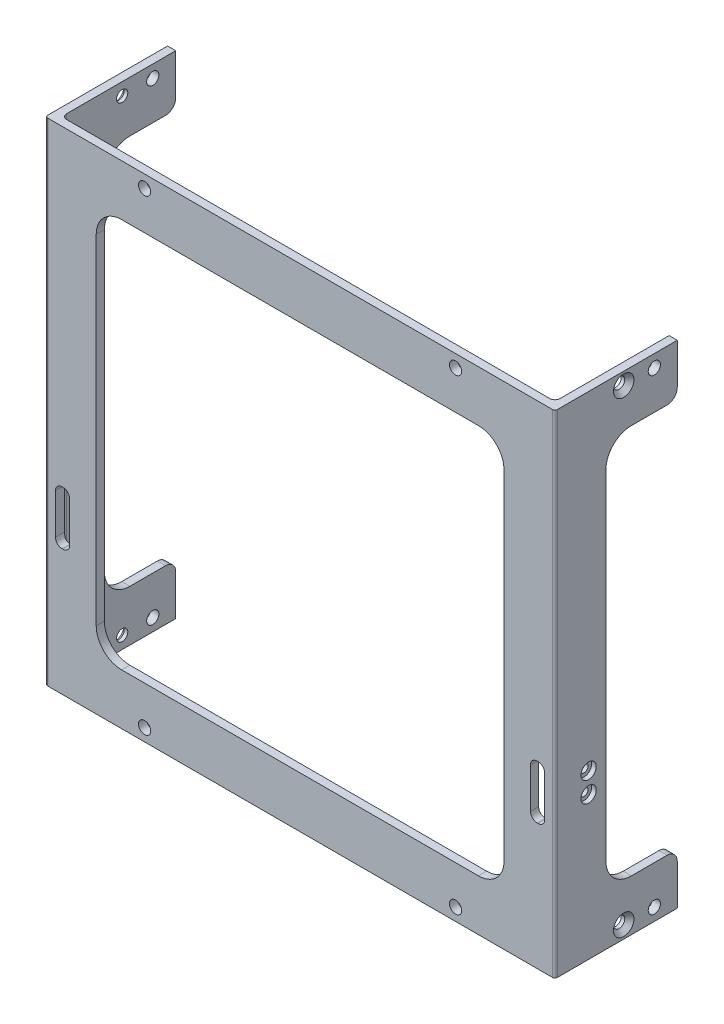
ISO-10303-21;
HEADER;
FILE_DESCRIPTION(('STEP AP214'),'2;1');
FILE_NAME('part.step','',(''),(''),'','','');
FILE_SCHEMA(('AUTOMOTIVE_DESIGN { 1 0 10303 214 1 1 1 1 }'));
ENDSEC;
DATA;
#1=APPLICATION_CONTEXT('core data for automotive mechanical design processes');
#2=APPLICATION_PROTOCOL_DEFINITION('international standard','automotive_design',2000,#1);
#3=PRODUCT_CONTEXT('',#1,'mechanical');
#4=PRODUCT('Part','Part','',(#3));
#5=PRODUCT_RELATED_PRODUCT_CATEGORY('part','',(#4));
#6=PRODUCT_DEFINITION_FORMATION('','',#4);
#7=PRODUCT_DEFINITION_CONTEXT('part definition',#1,'design');
#8=PRODUCT_DEFINITION('design','',#6,#7);
#9=PRODUCT_DEFINITION_SHAPE('','',#8);
#10=(LENGTH_UNIT() NAMED_UNIT(*) SI_UNIT(.MILLI.,.METRE.));
#11=(NAMED_UNIT(*) PLANE_ANGLE_UNIT() SI_UNIT($,.RADIAN.));
#12=(NAMED_UNIT(*) SI_UNIT($,.STERADIAN.) SOLID_ANGLE_UNIT());
#13=UNCERTAINTY_MEASURE_WITH_UNIT(LENGTH_MEASURE(1.E-05),#10,'distance_accuracy_value','');
#14=(GEOMETRIC_REPRESENTATION_CONTEXT(3) GLOBAL_UNCERTAINTY_ASSIGNED_CONTEXT((#13)) GLOBAL_UNIT_ASSIGNED_CONTEXT((#10,
#11,#12)) REPRESENTATION_CONTEXT('',''));
#15=CARTESIAN_POINT('',(0.,0.,0.));
#16=DIRECTION('',(0.,0.,1.));
#17=DIRECTION('',(1.,0.,0.));
#18=AXIS2_PLACEMENT_3D('',#15,#16,#17);
#19=CARTESIAN_POINT('',(49.9999999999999,96.5,-12.));
#20=DIRECTION('',(-1.,0.,0.));
#21=DIRECTION('',(0.,0.,1.));
#22=AXIS2_PLACEMENT_3D('',#19,#20,#21);
#23=PLANE('',#22);
#24=CARTESIAN_POINT('',(50.0000000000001,28.05,5.4));
#25=DIRECTION('',(1.,0.,0.));
#26=DIRECTION('',(0.,0.,-1.));
#27=AXIS2_PLACEMENT_3D('',#24,#25,#26);
#28=CIRCLE('',#27,1.5);
#29=CARTESIAN_POINT('',(50.0000000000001,28.05,3.9));
#30=VERTEX_POINT('',#29);
#31=EDGE_CURVE('E1787',#30,#30,#28,.T.);
#32=ORIENTED_EDGE('',*,*,#31,.F.);
#33=EDGE_LOOP('',(#32));
#34=FACE_BOUND('',#33,.T.);
#35=CARTESIAN_POINT('',(50.0000000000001,94.05,-7.5));
#36=DIRECTION('',(1.,0.,0.));
#37=DIRECTION('',(0.,0.,-1.));
#38=AXIS2_PLACEMENT_3D('',#35,#36,#37);
#39=CIRCLE('',#38,1.19999999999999);
#40=CARTESIAN_POINT('',(50.0000000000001,94.05,-8.7));
#41=VERTEX_POINT('',#40);
#42=EDGE_CURVE('E957',#41,#41,#39,.T.);
#43=ORIENTED_EDGE('',*,*,#42,.F.);
#44=EDGE_LOOP('',(#43));
#45=FACE_BOUND('',#44,.T.);
#46=CARTESIAN_POINT('',(50.0000000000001,94.05,-1.5));
#47=DIRECTION('',(1.,0.,0.));
#48=DIRECTION('',(0.,0.,-1.));
#49=AXIS2_PLACEMENT_3D('',#46,#47,#48);
#50=CIRCLE('',#49,2.);
#51=CARTESIAN_POINT('',(50.0000000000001,94.05,-3.5));
#52=VERTEX_POINT('',#51);
#53=EDGE_CURVE('E961',#52,#52,#50,.T.);
#54=ORIENTED_EDGE('',*,*,#53,.F.);
#55=EDGE_LOOP('',(#54));
#56=FACE_BOUND('',#55,.T.);
#57=CARTESIAN_POINT('',(50.0000000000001,2.45,-7.5));
#58=DIRECTION('',(1.,0.,0.));
#59=DIRECTION('',(0.,0.,-1.));
#60=AXIS2_PLACEMENT_3D('',#57,#58,#59);
#61=CIRCLE('',#60,1.2);
#62=CARTESIAN_POINT('',(50.0000000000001,2.45,-8.7));
#63=VERTEX_POINT('',#62);
#64=EDGE_CURVE('E974',#63,#63,#61,.T.);
#65=ORIENTED_EDGE('',*,*,#64,.F.);
#66=EDGE_LOOP('',(#65));
#67=FACE_BOUND('',#66,.T.);
#68=CARTESIAN_POINT('',(50.0000000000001,2.45,-1.5));
#69=DIRECTION('',(1.,0.,0.));
#70=DIRECTION('',(0.,0.,-1.));
#71=AXIS2_PLACEMENT_3D('',#68,#69,#70);
#72=CIRCLE('',#71,2.);
#73=CARTESIAN_POINT('',(50.0000000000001,2.45,-3.5));
#74=VERTEX_POINT('',#73);
#75=EDGE_CURVE('E743',#74,#74,#72,.T.);
#76=ORIENTED_EDGE('',*,*,#75,.F.);
#77=EDGE_LOOP('',(#76));
#78=FACE_BOUND('',#77,.T.);
#79=DIRECTION('',(0.,-1.,0.));
#80=VECTOR('',#79,1.);
#81=CARTESIAN_POINT('',(49.9999999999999,96.5,-12.));
#82=LINE('',#81,#80);
#83=CARTESIAN_POINT('',(49.9999999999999,8.00000000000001,-12.));
#84=VERTEX_POINT('',#83);
#85=CARTESIAN_POINT('',(49.9999999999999,0.,-12.));
#86=VERTEX_POINT('',#85);
#87=EDGE_CURVE('E777',#84,#86,#82,.T.);
#88=ORIENTED_EDGE('',*,*,#87,.F.);
#89=CARTESIAN_POINT('',(49.9999999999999,8.,-10.));
#90=DIRECTION('',(-1.,0.,0.));
#91=DIRECTION('',(0.,0.,1.));
#92=AXIS2_PLACEMENT_3D('',#89,#90,#91);
#93=CIRCLE('',#92,2.);
#94=CARTESIAN_POINT('',(49.9999999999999,10.,-10.));
#95=VERTEX_POINT('',#94);
#96=EDGE_CURVE('E840',#84,#95,#93,.F.);
#97=ORIENTED_EDGE('',*,*,#96,.T.);
#98=DIRECTION('',(0.,0.,-1.));
#99=VECTOR('',#98,1.);
#100=CARTESIAN_POINT('',(49.9999999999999,10.,-12.));
#101=LINE('',#100,#99);
#102=CARTESIAN_POINT('',(49.9999999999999,10.,-3.));
#103=VERTEX_POINT('',#102);
#104=EDGE_CURVE('E889',#103,#95,#101,.T.);
#105=ORIENTED_EDGE('',*,*,#104,.F.);
#106=CARTESIAN_POINT('',(49.9999999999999,15.,-3.));
#107=DIRECTION('',(-1.,0.,0.));
#108=DIRECTION('',(0.,0.,1.));
#109=AXIS2_PLACEMENT_3D('',#106,#107,#108);
#110=CIRCLE('',#109,5.);
#111=CARTESIAN_POINT('',(49.9999999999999,15.,2.));
#112=VERTEX_POINT('',#111);
#113=EDGE_CURVE('E505',#103,#112,#110,.T.);
#114=ORIENTED_EDGE('',*,*,#113,.T.);
#115=DIRECTION('',(0.,-1.,0.));
#116=VECTOR('',#115,1.);
#117=CARTESIAN_POINT('',(49.9999999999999,10.,2.));
#118=LINE('',#117,#116);
#119=CARTESIAN_POINT('',(49.9999999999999,81.5,2.));
#120=VERTEX_POINT('',#119);
#121=EDGE_CURVE('E895',#120,#112,#118,.T.);
#122=ORIENTED_EDGE('',*,*,#121,.F.);
#123=CARTESIAN_POINT('',(49.9999999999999,81.5,-3.));
#124=DIRECTION('',(-1.,0.,0.));
#125=DIRECTION('',(0.,0.,1.));
#126=AXIS2_PLACEMENT_3D('',#123,#124,#125);
#127=CIRCLE('',#126,5.);
#128=CARTESIAN_POINT('',(49.9999999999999,86.5,-3.));
#129=VERTEX_POINT('',#128);
#130=EDGE_CURVE('E500',#120,#129,#127,.T.);
#131=ORIENTED_EDGE('',*,*,#130,.T.);
#132=DIRECTION('',(0.,0.,1.));
#133=VECTOR('',#132,1.);
#134=CARTESIAN_POINT('',(49.9999999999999,86.5,2.));
#135=LINE('',#134,#133);
#136=CARTESIAN_POINT('',(49.9999999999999,86.5,-10.));
#137=VERTEX_POINT('',#136);
#138=EDGE_CURVE('E892',#137,#129,#135,.T.);
#139=ORIENTED_EDGE('',*,*,#138,.F.);
#140=CARTESIAN_POINT('',(49.9999999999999,88.5,-10.));
#141=DIRECTION('',(-1.,0.,0.));
#142=DIRECTION('',(0.,0.,1.));
#143=AXIS2_PLACEMENT_3D('',#140,#141,#142);
#144=CIRCLE('',#143,2.);
#145=CARTESIAN_POINT('',(49.9999999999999,88.5,-12.));
#146=VERTEX_POINT('',#145);
#147=EDGE_CURVE('E49',#137,#146,#144,.F.);
#148=ORIENTED_EDGE('',*,*,#147,.T.);
#149=CARTESIAN_POINT('',(49.9999999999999,96.5,-12.));
#150=VERTEX_POINT('',#149);
#151=EDGE_CURVE('E799',#150,#146,#82,.T.);
#152=ORIENTED_EDGE('',*,*,#151,.F.);
#153=DIRECTION('',(0.,0.,-1.));
#154=VECTOR('',#153,1.);
#155=CARTESIAN_POINT('',(49.9999999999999,96.5,-12.));
#156=LINE('',#155,#154);
#157=CARTESIAN_POINT('',(49.9999999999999,96.5,11.5));
#158=VERTEX_POINT('',#157);
#159=EDGE_CURVE('E393',#158,#150,#156,.T.);
#160=ORIENTED_EDGE('',*,*,#159,.F.);
#161=DIRECTION('',(0.,-1.,0.));
#162=VECTOR('',#161,1.);
#163=CARTESIAN_POINT('',(49.9999999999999,96.5,11.5));
#164=LINE('',#163,#162);
#165=CARTESIAN_POINT('',(49.9999999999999,0.,11.5));
#166=VERTEX_POINT('',#165);
#167=EDGE_CURVE('E445',#158,#166,#164,.T.);
#168=ORIENTED_EDGE('',*,*,#167,.T.);
#169=DIRECTION('',(0.,0.,-1.));
#170=VECTOR('',#169,1.);
#171=CARTESIAN_POINT('',(49.9999999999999,0.,-12.));
#172=LINE('',#171,#170);
#173=EDGE_CURVE('E395',#166,#86,#172,.T.);
#174=ORIENTED_EDGE('',*,*,#173,.T.);
#175=EDGE_LOOP('',(#88,#97,#105,#114,#122,#131,#139,#148,#152,#160,#168,#174));
#176=FACE_BOUND('',#175,.T.);
#177=CARTESIAN_POINT('',(50.0000000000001,32.05,5.4));
#178=DIRECTION('',(1.,0.,0.));
#179=DIRECTION('',(0.,0.,-1.));
#180=AXIS2_PLACEMENT_3D('',#177,#178,#179);
#181=CIRCLE('',#180,1.5);
#182=CARTESIAN_POINT('',(50.0000000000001,32.05,3.89999999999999));
#183=VERTEX_POINT('',#182);
#184=EDGE_CURVE('E1797',#183,#183,#181,.T.);
#185=ORIENTED_EDGE('',*,*,#184,.F.);
#186=EDGE_LOOP('',(#185));
#187=FACE_BOUND('',#186,.T.);
#188=ADVANCED_FACE('F34',(#34,#45,#56,#67,#78,#176,#187),#23,.F.);
#189=CARTESIAN_POINT('',(48.4,96.5,10.4));
#190=DIRECTION('',(0.,0.,1.));
#191=DIRECTION('',(1.,0.,0.));
#192=AXIS2_PLACEMENT_3D('',#189,#190,#191);
#193=PLANE('',#192);
#194=CARTESIAN_POINT('',(-30.5,2.44999999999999,10.4));
#195=DIRECTION('',(0.,0.,1.));
#196=DIRECTION('',(1.,0.,0.));
#197=AXIS2_PLACEMENT_3D('',#194,#195,#196);
#198=CIRCLE('',#197,1.2);
#199=CARTESIAN_POINT('',(-29.3,2.44999999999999,10.4));
#200=VERTEX_POINT('',#199);
#201=EDGE_CURVE('E740',#200,#200,#198,.T.);
#202=ORIENTED_EDGE('',*,*,#201,.T.);
#203=EDGE_LOOP('',(#202));
#204=FACE_BOUND('',#203,.T.);
#205=CARTESIAN_POINT('',(30.5,2.44999999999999,10.4));
#206=DIRECTION('',(0.,0.,1.));
#207=DIRECTION('',(1.,0.,0.));
#208=AXIS2_PLACEMENT_3D('',#205,#206,#207);
#209=CIRCLE('',#208,1.2);
#210=CARTESIAN_POINT('',(31.7,2.44999999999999,10.4));
#211=VERTEX_POINT('',#210);
#212=EDGE_CURVE('E971',#211,#211,#209,.T.);
#213=ORIENTED_EDGE('',*,*,#212,.T.);
#214=EDGE_LOOP('',(#213));
#215=FACE_BOUND('',#214,.T.);
#216=CARTESIAN_POINT('',(30.5,94.05,10.4));
#217=DIRECTION('',(0.,0.,1.));
#218=DIRECTION('',(1.,0.,0.));
#219=AXIS2_PLACEMENT_3D('',#216,#217,#218);
#220=CIRCLE('',#219,1.2);
#221=CARTESIAN_POINT('',(31.7,94.05,10.4));
#222=VERTEX_POINT('',#221);
#223=EDGE_CURVE('E954',#222,#222,#220,.T.);
#224=ORIENTED_EDGE('',*,*,#223,.T.);
#225=EDGE_LOOP('',(#224));
#226=FACE_BOUND('',#225,.T.);
#227=CARTESIAN_POINT('',(-30.5,94.05,10.4));
#228=DIRECTION('',(0.,0.,1.));
#229=DIRECTION('',(1.,0.,0.));
#230=AXIS2_PLACEMENT_3D('',#227,#228,#229);
#231=CIRCLE('',#230,1.2);
#232=CARTESIAN_POINT('',(-29.3,94.05,10.4));
#233=VERTEX_POINT('',#232);
#234=EDGE_CURVE('E933',#233,#233,#231,.T.);
#235=ORIENTED_EDGE('',*,*,#234,.T.);
#236=EDGE_LOOP('',(#235));
#237=FACE_BOUND('',#236,.T.);
#238=DIRECTION('',(1.,0.,0.));
#239=VECTOR('',#238,1.);
#240=CARTESIAN_POINT('',(39.9999999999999,86.5,10.4));
#241=LINE('',#240,#239);
#242=CARTESIAN_POINT('',(-35.0000000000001,86.5,10.4));
#243=VERTEX_POINT('',#242);
#244=CARTESIAN_POINT('',(34.9999999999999,86.5,10.4));
#245=VERTEX_POINT('',#244);
#246=EDGE_CURVE('E910',#243,#245,#241,.T.);
#247=ORIENTED_EDGE('',*,*,#246,.F.);
#248=CARTESIAN_POINT('',(-35.0000000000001,81.5,10.4));
#249=DIRECTION('',(0.,0.,1.));
#250=DIRECTION('',(1.,0.,0.));
#251=AXIS2_PLACEMENT_3D('',#248,#249,#250);
#252=CIRCLE('',#251,5.);
#253=CARTESIAN_POINT('',(-40.0000000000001,81.5,10.4));
#254=VERTEX_POINT('',#253);
#255=EDGE_CURVE('E521',#243,#254,#252,.T.);
#256=ORIENTED_EDGE('',*,*,#255,.T.);
#257=DIRECTION('',(0.,1.,0.));
#258=VECTOR('',#257,1.);
#259=CARTESIAN_POINT('',(-40.0000000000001,86.5,10.4));
#260=LINE('',#259,#258);
#261=CARTESIAN_POINT('',(-40.0000000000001,15.,10.4));
#262=VERTEX_POINT('',#261);
#263=EDGE_CURVE('E914',#262,#254,#260,.T.);
#264=ORIENTED_EDGE('',*,*,#263,.F.);
#265=CARTESIAN_POINT('',(-35.0000000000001,15.,10.4));
#266=DIRECTION('',(0.,0.,1.));
#267=DIRECTION('',(1.,0.,0.));
#268=AXIS2_PLACEMENT_3D('',#265,#266,#267);
#269=CIRCLE('',#268,5.);
#270=CARTESIAN_POINT('',(-35.0000000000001,10.,10.4));
#271=VERTEX_POINT('',#270);
#272=EDGE_CURVE('E509',#262,#271,#269,.T.);
#273=ORIENTED_EDGE('',*,*,#272,.T.);
#274=DIRECTION('',(-1.,0.,0.));
#275=VECTOR('',#274,1.);
#276=CARTESIAN_POINT('',(-40.0000000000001,10.,10.4));
#277=LINE('',#276,#275);
#278=CARTESIAN_POINT('',(34.9999999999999,10.,10.4));
#279=VERTEX_POINT('',#278);
#280=EDGE_CURVE('E917',#279,#271,#277,.T.);
#281=ORIENTED_EDGE('',*,*,#280,.F.);
#282=CARTESIAN_POINT('',(34.9999999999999,15.,10.4));
#283=DIRECTION('',(0.,0.,1.));
#284=DIRECTION('',(1.,0.,0.));
#285=AXIS2_PLACEMENT_3D('',#282,#283,#284);
#286=CIRCLE('',#285,5.);
#287=CARTESIAN_POINT('',(39.9999999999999,15.,10.4));
#288=VERTEX_POINT('',#287);
#289=EDGE_CURVE('E513',#279,#288,#286,.T.);
#290=ORIENTED_EDGE('',*,*,#289,.T.);
#291=DIRECTION('',(0.,-1.,0.));
#292=VECTOR('',#291,1.);
#293=CARTESIAN_POINT('',(39.9999999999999,10.,10.4));
#294=LINE('',#293,#292);
#295=CARTESIAN_POINT('',(39.9999999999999,81.5,10.4));
#296=VERTEX_POINT('',#295);
#297=EDGE_CURVE('E907',#296,#288,#294,.T.);
#298=ORIENTED_EDGE('',*,*,#297,.F.);
#299=CARTESIAN_POINT('',(34.9999999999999,81.5,10.4));
#300=DIRECTION('',(0.,0.,1.));
#301=DIRECTION('',(1.,0.,0.));
#302=AXIS2_PLACEMENT_3D('',#299,#300,#301);
#303=CIRCLE('',#302,5.);
#304=EDGE_CURVE('E517',#296,#245,#303,.T.);
#305=ORIENTED_EDGE('',*,*,#304,.T.);
#306=EDGE_LOOP('',(#247,#256,#264,#273,#281,#290,#298,#305));
#307=FACE_BOUND('',#306,.T.);
#308=DIRECTION('',(-1.,0.,0.));
#309=VECTOR('',#308,1.);
#310=CARTESIAN_POINT('',(48.4,24.75,10.4));
#311=LINE('',#310,#309);
#312=CARTESIAN_POINT('',(46.7000000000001,24.75,10.4));
#313=VERTEX_POINT('',#312);
#314=CARTESIAN_POINT('',(46.5000000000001,24.75,10.4));
#315=VERTEX_POINT('',#314);
#316=EDGE_CURVE('E1762',#313,#315,#311,.T.);
#317=ORIENTED_EDGE('',*,*,#316,.F.);
#318=CARTESIAN_POINT('',(46.7000000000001,26.05,10.4));
#319=DIRECTION('',(0.,0.,1.));
#320=DIRECTION('',(1.,0.,0.));
#321=AXIS2_PLACEMENT_3D('',#318,#319,#320);
#322=CIRCLE('',#321,1.3);
#323=CARTESIAN_POINT('',(47.4,24.9545548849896,10.4));
#324=VERTEX_POINT('',#323);
#325=EDGE_CURVE('E565',#313,#324,#322,.T.);
#326=ORIENTED_EDGE('',*,*,#325,.T.);
#327=DIRECTION('',(0.,-1.,0.));
#328=VECTOR('',#327,1.);
#329=CARTESIAN_POINT('',(47.4,0.,10.4));
#330=LINE('',#329,#328);
#331=CARTESIAN_POINT('',(47.4,0.,10.4));
#332=VERTEX_POINT('',#331);
#333=EDGE_CURVE('E404',#324,#332,#330,.T.);
#334=ORIENTED_EDGE('',*,*,#333,.T.);
#335=DIRECTION('',(-1.,0.,0.));
#336=VECTOR('',#335,1.);
#337=CARTESIAN_POINT('',(48.4,0.,10.4));
#338=LINE('',#337,#336);
#339=CARTESIAN_POINT('',(-47.4,0.,10.4));
#340=VERTEX_POINT('',#339);
#341=EDGE_CURVE('E782',#332,#340,#338,.T.);
#342=ORIENTED_EDGE('',*,*,#341,.T.);
#343=DIRECTION('',(0.,-1.,0.));
#344=VECTOR('',#343,1.);
#345=CARTESIAN_POINT('',(-47.4,96.5,10.4));
#346=LINE('',#345,#344);
#347=CARTESIAN_POINT('',(-47.4,24.9545548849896,10.4));
#348=VERTEX_POINT('',#347);
#349=EDGE_CURVE('E413',#340,#348,#346,.F.);
#350=ORIENTED_EDGE('',*,*,#349,.T.);
#351=CARTESIAN_POINT('',(-46.7000000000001,26.05,10.4));
#352=DIRECTION('',(0.,0.,1.));
#353=DIRECTION('',(1.,0.,0.));
#354=AXIS2_PLACEMENT_3D('',#351,#352,#353);
#355=CIRCLE('',#354,1.3);
#356=CARTESIAN_POINT('',(-46.7000000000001,24.75,10.4));
#357=VERTEX_POINT('',#356);
#358=EDGE_CURVE('E628',#348,#357,#355,.T.);
#359=ORIENTED_EDGE('',*,*,#358,.T.);
#360=DIRECTION('',(1.,0.,0.));
#361=VECTOR('',#360,1.);
#362=CARTESIAN_POINT('',(48.4,24.75,10.4));
#363=LINE('',#362,#361);
#364=CARTESIAN_POINT('',(-46.5000000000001,24.75,10.4));
#365=VERTEX_POINT('',#364);
#366=EDGE_CURVE('E1717',#357,#365,#363,.T.);
#367=ORIENTED_EDGE('',*,*,#366,.T.);
#368=CARTESIAN_POINT('',(-46.5000000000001,26.05,10.4));
#369=DIRECTION('',(0.,0.,1.));
#370=DIRECTION('',(1.,0.,0.));
#371=AXIS2_PLACEMENT_3D('',#368,#369,#370);
#372=CIRCLE('',#371,1.3);
#373=CARTESIAN_POINT('',(-45.2000000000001,26.05,10.4));
#374=VERTEX_POINT('',#373);
#375=EDGE_CURVE('E1689',#365,#374,#372,.T.);
#376=ORIENTED_EDGE('',*,*,#375,.T.);
#377=DIRECTION('',(0.,1.,0.));
#378=VECTOR('',#377,1.);
#379=CARTESIAN_POINT('',(-45.2000000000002,96.4999999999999,10.4));
#380=LINE('',#379,#378);
#381=CARTESIAN_POINT('',(-45.2000000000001,33.95,10.4));
#382=VERTEX_POINT('',#381);
#383=EDGE_CURVE('E1657',#374,#382,#380,.T.);
#384=ORIENTED_EDGE('',*,*,#383,.T.);
#385=CARTESIAN_POINT('',(-46.5000000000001,33.95,10.4));
#386=DIRECTION('',(0.,0.,1.));
#387=DIRECTION('',(1.,0.,0.));
#388=AXIS2_PLACEMENT_3D('',#385,#386,#387);
#389=CIRCLE('',#388,1.3);
#390=CARTESIAN_POINT('',(-46.5000000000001,35.25,10.4));
#391=VERTEX_POINT('',#390);
#392=EDGE_CURVE('E1698',#382,#391,#389,.T.);
#393=ORIENTED_EDGE('',*,*,#392,.T.);
#394=DIRECTION('',(-1.,0.,0.));
#395=VECTOR('',#394,1.);
#396=CARTESIAN_POINT('',(48.4,35.25,10.4));
#397=LINE('',#396,#395);
#398=CARTESIAN_POINT('',(-46.7000000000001,35.25,10.4));
#399=VERTEX_POINT('',#398);
#400=EDGE_CURVE('E1709',#391,#399,#397,.T.);
#401=ORIENTED_EDGE('',*,*,#400,.T.);
#402=CARTESIAN_POINT('',(-46.7000000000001,33.95,10.4));
#403=DIRECTION('',(0.,0.,1.));
#404=DIRECTION('',(1.,0.,0.));
#405=AXIS2_PLACEMENT_3D('',#402,#403,#404);
#406=CIRCLE('',#405,1.3);
#407=CARTESIAN_POINT('',(-47.4,35.0454451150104,10.4));
#408=VERTEX_POINT('',#407);
#409=EDGE_CURVE('E650',#399,#408,#406,.T.);
#410=ORIENTED_EDGE('',*,*,#409,.T.);
#411=CARTESIAN_POINT('',(-47.4,96.5,10.4));
#412=VERTEX_POINT('',#411);
#413=EDGE_CURVE('E412',#408,#412,#346,.F.);
#414=ORIENTED_EDGE('',*,*,#413,.T.);
#415=DIRECTION('',(-1.,0.,0.));
#416=VECTOR('',#415,1.);
#417=CARTESIAN_POINT('',(48.4,96.5,10.4));
#418=LINE('',#417,#416);
#419=CARTESIAN_POINT('',(47.4,96.5,10.4));
#420=VERTEX_POINT('',#419);
#421=EDGE_CURVE('E386',#420,#412,#418,.T.);
#422=ORIENTED_EDGE('',*,*,#421,.F.);
#423=CARTESIAN_POINT('',(47.4,35.0454451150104,10.4));
#424=VERTEX_POINT('',#423);
#425=EDGE_CURVE('E410',#420,#424,#330,.T.);
#426=ORIENTED_EDGE('',*,*,#425,.T.);
#427=CARTESIAN_POINT('',(46.7000000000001,33.95,10.4));
#428=DIRECTION('',(0.,0.,1.));
#429=DIRECTION('',(1.,0.,0.));
#430=AXIS2_PLACEMENT_3D('',#427,#428,#429);
#431=CIRCLE('',#430,1.3);
#432=CARTESIAN_POINT('',(46.7000000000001,35.25,10.4));
#433=VERTEX_POINT('',#432);
#434=EDGE_CURVE('E615',#424,#433,#431,.T.);
#435=ORIENTED_EDGE('',*,*,#434,.T.);
#436=DIRECTION('',(1.,0.,0.));
#437=VECTOR('',#436,1.);
#438=CARTESIAN_POINT('',(48.4,35.25,10.4));
#439=LINE('',#438,#437);
#440=CARTESIAN_POINT('',(46.5000000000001,35.25,10.4));
#441=VERTEX_POINT('',#440);
#442=EDGE_CURVE('E1765',#441,#433,#439,.T.);
#443=ORIENTED_EDGE('',*,*,#442,.F.);
#444=CARTESIAN_POINT('',(46.5000000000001,33.95,10.4));
#445=DIRECTION('',(0.,0.,1.));
#446=DIRECTION('',(1.,0.,0.));
#447=AXIS2_PLACEMENT_3D('',#444,#445,#446);
#448=CIRCLE('',#447,1.3);
#449=CARTESIAN_POINT('',(45.2000000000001,33.95,10.4));
#450=VERTEX_POINT('',#449);
#451=EDGE_CURVE('E1828',#441,#450,#448,.T.);
#452=ORIENTED_EDGE('',*,*,#451,.T.);
#453=DIRECTION('',(0.,1.,0.));
#454=VECTOR('',#453,1.);
#455=CARTESIAN_POINT('',(45.2000000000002,96.5,10.4));
#456=LINE('',#455,#454);
#457=CARTESIAN_POINT('',(45.2000000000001,26.05,10.4));
#458=VERTEX_POINT('',#457);
#459=EDGE_CURVE('E1759',#458,#450,#456,.T.);
#460=ORIENTED_EDGE('',*,*,#459,.F.);
#461=CARTESIAN_POINT('',(46.5000000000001,26.05,10.4));
#462=DIRECTION('',(0.,0.,1.));
#463=DIRECTION('',(1.,0.,0.));
#464=AXIS2_PLACEMENT_3D('',#461,#462,#463);
#465=CIRCLE('',#464,1.3);
#466=EDGE_CURVE('E1825',#458,#315,#465,.T.);
#467=ORIENTED_EDGE('',*,*,#466,.T.);
#468=EDGE_LOOP('',(#317,#326,#334,#342,#350,#359,#367,#376,#384,#393,#401,#410,#414,#422,#426,
#435,#443,#452,#460,#467));
#469=FACE_BOUND('',#468,.T.);
#470=ADVANCED_FACE('F676',(#204,#215,#226,#237,#307,#469),#193,.F.);
#471=CARTESIAN_POINT('',(49.9999999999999,96.5,12.));
#472=DIRECTION('',(0.,0.,-1.));
#473=DIRECTION('',(-1.,0.,0.));
#474=AXIS2_PLACEMENT_3D('',#471,#472,#473);
#475=PLANE('',#474);
#476=DIRECTION('',(1.,0.,0.));
#477=VECTOR('',#476,1.);
#478=CARTESIAN_POINT('',(49.9999999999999,96.5,12.));
#479=LINE('',#478,#477);
#480=CARTESIAN_POINT('',(-49.5000000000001,96.5,12.));
#481=VERTEX_POINT('',#480);
#482=CARTESIAN_POINT('',(49.4999999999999,96.5,12.));
#483=VERTEX_POINT('',#482);
#484=EDGE_CURVE('E773',#481,#483,#479,.T.);
#485=ORIENTED_EDGE('',*,*,#484,.F.);
#486=DIRECTION('',(0.,-1.,0.));
#487=VECTOR('',#486,1.);
#488=CARTESIAN_POINT('',(-49.5000000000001,96.5,12.));
#489=LINE('',#488,#487);
#490=CARTESIAN_POINT('',(-49.5000000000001,0.,12.));
#491=VERTEX_POINT('',#490);
#492=EDGE_CURVE('E432',#481,#491,#489,.T.);
#493=ORIENTED_EDGE('',*,*,#492,.T.);
#494=DIRECTION('',(1.,0.,0.));
#495=VECTOR('',#494,1.);
#496=CARTESIAN_POINT('',(49.9999999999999,0.,12.));
#497=LINE('',#496,#495);
#498=CARTESIAN_POINT('',(49.4999999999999,0.,12.));
#499=VERTEX_POINT('',#498);
#500=EDGE_CURVE('E794',#491,#499,#497,.T.);
#501=ORIENTED_EDGE('',*,*,#500,.T.);
#502=DIRECTION('',(0.,-1.,0.));
#503=VECTOR('',#502,1.);
#504=CARTESIAN_POINT('',(49.4999999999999,96.5,12.));
#505=LINE('',#504,#503);
#506=EDGE_CURVE('E430',#499,#483,#505,.F.);
#507=ORIENTED_EDGE('',*,*,#506,.T.);
#508=EDGE_LOOP('',(#485,#493,#501,#507));
#509=FACE_BOUND('',#508,.T.);
#510=CARTESIAN_POINT('',(-30.5,2.44999999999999,12.));
#511=DIRECTION('',(0.,0.,1.));
#512=DIRECTION('',(1.,0.,0.));
#513=AXIS2_PLACEMENT_3D('',#510,#511,#512);
#514=CIRCLE('',#513,1.2);
#515=CARTESIAN_POINT('',(-29.3,2.44999999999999,12.));
#516=VERTEX_POINT('',#515);
#517=EDGE_CURVE('E736',#516,#516,#514,.T.);
#518=ORIENTED_EDGE('',*,*,#517,.F.);
#519=EDGE_LOOP('',(#518));
#520=FACE_BOUND('',#519,.T.);
#521=CARTESIAN_POINT('',(30.5,2.44999999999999,12.));
#522=DIRECTION('',(0.,0.,1.));
#523=DIRECTION('',(1.,0.,0.));
#524=AXIS2_PLACEMENT_3D('',#521,#522,#523);
#525=CIRCLE('',#524,1.2);
#526=CARTESIAN_POINT('',(31.7,2.44999999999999,12.));
#527=VERTEX_POINT('',#526);
#528=EDGE_CURVE('E968',#527,#527,#525,.T.);
#529=ORIENTED_EDGE('',*,*,#528,.F.);
#530=EDGE_LOOP('',(#529));
#531=FACE_BOUND('',#530,.T.);
#532=CARTESIAN_POINT('',(30.5,94.05,12.));
#533=DIRECTION('',(0.,0.,1.));
#534=DIRECTION('',(1.,0.,0.));
#535=AXIS2_PLACEMENT_3D('',#532,#533,#534);
#536=CIRCLE('',#535,1.2);
#537=CARTESIAN_POINT('',(31.7,94.05,12.));
#538=VERTEX_POINT('',#537);
#539=EDGE_CURVE('E951',#538,#538,#536,.T.);
#540=ORIENTED_EDGE('',*,*,#539,.F.);
#541=EDGE_LOOP('',(#540));
#542=FACE_BOUND('',#541,.T.);
#543=CARTESIAN_POINT('',(-30.5,94.05,12.));
#544=DIRECTION('',(0.,0.,1.));
#545=DIRECTION('',(1.,0.,0.));
#546=AXIS2_PLACEMENT_3D('',#543,#544,#545);
#547=CIRCLE('',#546,1.2);
#548=CARTESIAN_POINT('',(-29.3,94.05,12.));
#549=VERTEX_POINT('',#548);
#550=EDGE_CURVE('E930',#549,#549,#547,.T.);
#551=ORIENTED_EDGE('',*,*,#550,.F.);
#552=EDGE_LOOP('',(#551));
#553=FACE_BOUND('',#552,.T.);
#554=DIRECTION('',(1.,0.,0.));
#555=VECTOR('',#554,1.);
#556=CARTESIAN_POINT('',(-40.0000000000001,10.,12.));
#557=LINE('',#556,#555);
#558=CARTESIAN_POINT('',(-35.0000000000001,10.,12.));
#559=VERTEX_POINT('',#558);
#560=CARTESIAN_POINT('',(34.9999999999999,10.,12.));
#561=VERTEX_POINT('',#560);
#562=EDGE_CURVE('E920',#559,#561,#557,.T.);
#563=ORIENTED_EDGE('',*,*,#562,.F.);
#564=CARTESIAN_POINT('',(-35.0000000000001,15.,12.));
#565=DIRECTION('',(0.,0.,-1.));
#566=DIRECTION('',(-1.,0.,0.));
#567=AXIS2_PLACEMENT_3D('',#564,#565,#566);
#568=CIRCLE('',#567,5.);
#569=CARTESIAN_POINT('',(-40.0000000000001,15.,12.));
#570=VERTEX_POINT('',#569);
#571=EDGE_CURVE('E507',#559,#570,#568,.T.);
#572=ORIENTED_EDGE('',*,*,#571,.T.);
#573=DIRECTION('',(0.,-1.,0.));
#574=VECTOR('',#573,1.);
#575=CARTESIAN_POINT('',(-40.0000000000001,86.5,12.));
#576=LINE('',#575,#574);
#577=CARTESIAN_POINT('',(-40.0000000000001,81.5,12.));
#578=VERTEX_POINT('',#577);
#579=EDGE_CURVE('E906',#578,#570,#576,.T.);
#580=ORIENTED_EDGE('',*,*,#579,.F.);
#581=CARTESIAN_POINT('',(-35.0000000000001,81.5,12.));
#582=DIRECTION('',(0.,0.,-1.));
#583=DIRECTION('',(-1.,0.,0.));
#584=AXIS2_PLACEMENT_3D('',#581,#582,#583);
#585=CIRCLE('',#584,5.);
#586=CARTESIAN_POINT('',(-35.0000000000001,86.5,12.));
#587=VERTEX_POINT('',#586);
#588=EDGE_CURVE('E519',#578,#587,#585,.T.);
#589=ORIENTED_EDGE('',*,*,#588,.T.);
#590=DIRECTION('',(-1.,0.,0.));
#591=VECTOR('',#590,1.);
#592=CARTESIAN_POINT('',(39.9999999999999,86.5,12.));
#593=LINE('',#592,#591);
#594=CARTESIAN_POINT('',(34.9999999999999,86.5,12.));
#595=VERTEX_POINT('',#594);
#596=EDGE_CURVE('E911',#595,#587,#593,.T.);
#597=ORIENTED_EDGE('',*,*,#596,.F.);
#598=CARTESIAN_POINT('',(34.9999999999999,81.5,12.));
#599=DIRECTION('',(0.,0.,-1.));
#600=DIRECTION('',(-1.,0.,0.));
#601=AXIS2_PLACEMENT_3D('',#598,#599,#600);
#602=CIRCLE('',#601,5.);
#603=CARTESIAN_POINT('',(39.9999999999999,81.5,12.));
#604=VERTEX_POINT('',#603);
#605=EDGE_CURVE('E515',#595,#604,#602,.T.);
#606=ORIENTED_EDGE('',*,*,#605,.T.);
#607=DIRECTION('',(0.,1.,0.));
#608=VECTOR('',#607,1.);
#609=CARTESIAN_POINT('',(39.9999999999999,10.,12.));
#610=LINE('',#609,#608);
#611=CARTESIAN_POINT('',(39.9999999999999,15.,12.));
#612=VERTEX_POINT('',#611);
#613=EDGE_CURVE('E923',#612,#604,#610,.T.);
#614=ORIENTED_EDGE('',*,*,#613,.F.);
#615=CARTESIAN_POINT('',(34.9999999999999,15.,12.));
#616=DIRECTION('',(0.,0.,-1.));
#617=DIRECTION('',(-1.,0.,0.));
#618=AXIS2_PLACEMENT_3D('',#615,#616,#617);
#619=CIRCLE('',#618,5.);
#620=EDGE_CURVE('E511',#612,#561,#619,.T.);
#621=ORIENTED_EDGE('',*,*,#620,.T.);
#622=EDGE_LOOP('',(#563,#572,#580,#589,#597,#606,#614,#621));
#623=FACE_BOUND('',#622,.T.);
#624=DIRECTION('',(1.,0.,0.));
#625=VECTOR('',#624,1.);
#626=CARTESIAN_POINT('',(-48.0000000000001,24.75,12.));
#627=LINE('',#626,#625);
#628=CARTESIAN_POINT('',(-46.7000000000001,24.75,12.));
#629=VERTEX_POINT('',#628);
#630=CARTESIAN_POINT('',(-46.5000000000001,24.75,12.));
#631=VERTEX_POINT('',#630);
#632=EDGE_CURVE('E1715',#629,#631,#627,.T.);
#633=ORIENTED_EDGE('',*,*,#632,.F.);
#634=CARTESIAN_POINT('',(-46.7000000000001,26.05,12.));
#635=DIRECTION('',(0.,0.,-1.));
#636=DIRECTION('',(-1.,0.,0.));
#637=AXIS2_PLACEMENT_3D('',#634,#635,#636);
#638=CIRCLE('',#637,1.3);
#639=CARTESIAN_POINT('',(-48.0000000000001,26.05,12.));
#640=VERTEX_POINT('',#639);
#641=EDGE_CURVE('E619',#629,#640,#638,.T.);
#642=ORIENTED_EDGE('',*,*,#641,.T.);
#643=DIRECTION('',(0.,-1.,0.));
#644=VECTOR('',#643,1.);
#645=CARTESIAN_POINT('',(-48.0000000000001,35.25,12.));
#646=LINE('',#645,#644);
#647=CARTESIAN_POINT('',(-48.0000000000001,33.95,12.));
#648=VERTEX_POINT('',#647);
#649=EDGE_CURVE('E1714',#648,#640,#646,.T.);
#650=ORIENTED_EDGE('',*,*,#649,.F.);
#651=CARTESIAN_POINT('',(-46.7000000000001,33.95,12.));
#652=DIRECTION('',(0.,0.,-1.));
#653=DIRECTION('',(-1.,0.,0.));
#654=AXIS2_PLACEMENT_3D('',#651,#652,#653);
#655=CIRCLE('',#654,1.3);
#656=CARTESIAN_POINT('',(-46.7000000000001,35.25,12.));
#657=VERTEX_POINT('',#656);
#658=EDGE_CURVE('E1699',#648,#657,#655,.T.);
#659=ORIENTED_EDGE('',*,*,#658,.T.);
#660=DIRECTION('',(-1.,0.,0.));
#661=VECTOR('',#660,1.);
#662=CARTESIAN_POINT('',(-48.0000000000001,35.25,12.));
#663=LINE('',#662,#661);
#664=CARTESIAN_POINT('',(-46.5000000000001,35.25,12.));
#665=VERTEX_POINT('',#664);
#666=EDGE_CURVE('E1722',#665,#657,#663,.T.);
#667=ORIENTED_EDGE('',*,*,#666,.F.);
#668=CARTESIAN_POINT('',(-46.5000000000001,33.95,12.));
#669=DIRECTION('',(0.,0.,-1.));
#670=DIRECTION('',(-1.,0.,0.));
#671=AXIS2_PLACEMENT_3D('',#668,#669,#670);
#672=CIRCLE('',#671,1.3);
#673=CARTESIAN_POINT('',(-45.2000000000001,33.95,12.));
#674=VERTEX_POINT('',#673);
#675=EDGE_CURVE('E1694',#665,#674,#672,.T.);
#676=ORIENTED_EDGE('',*,*,#675,.T.);
#677=DIRECTION('',(0.,1.,0.));
#678=VECTOR('',#677,1.);
#679=CARTESIAN_POINT('',(-45.2000000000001,35.25,12.));
#680=LINE('',#679,#678);
#681=CARTESIAN_POINT('',(-45.2000000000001,26.05,12.));
#682=VERTEX_POINT('',#681);
#683=EDGE_CURVE('E1719',#682,#674,#680,.T.);
#684=ORIENTED_EDGE('',*,*,#683,.F.);
#685=CARTESIAN_POINT('',(-46.5000000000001,26.05,12.));
#686=DIRECTION('',(0.,0.,-1.));
#687=DIRECTION('',(-1.,0.,0.));
#688=AXIS2_PLACEMENT_3D('',#685,#686,#687);
#689=CIRCLE('',#688,1.3);
#690=EDGE_CURVE('E1688',#682,#631,#689,.T.);
#691=ORIENTED_EDGE('',*,*,#690,.T.);
#692=EDGE_LOOP('',(#633,#642,#650,#659,#667,#676,#684,#691));
#693=FACE_BOUND('',#692,.T.);
#694=DIRECTION('',(1.,0.,0.));
#695=VECTOR('',#694,1.);
#696=CARTESIAN_POINT('',(48.0000000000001,35.25,12.));
#697=LINE('',#696,#695);
#698=CARTESIAN_POINT('',(46.5000000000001,35.25,12.));
#699=VERTEX_POINT('',#698);
#700=CARTESIAN_POINT('',(46.7000000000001,35.25,12.));
#701=VERTEX_POINT('',#700);
#702=EDGE_CURVE('E1774',#699,#701,#697,.T.);
#703=ORIENTED_EDGE('',*,*,#702,.T.);
#704=CARTESIAN_POINT('',(46.7000000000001,33.95,12.));
#705=DIRECTION('',(0.,0.,-1.));
#706=DIRECTION('',(-1.,0.,0.));
#707=AXIS2_PLACEMENT_3D('',#704,#705,#706);
#708=CIRCLE('',#707,1.3);
#709=CARTESIAN_POINT('',(48.0000000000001,33.95,12.));
#710=VERTEX_POINT('',#709);
#711=EDGE_CURVE('E616',#701,#710,#708,.T.);
#712=ORIENTED_EDGE('',*,*,#711,.T.);
#713=DIRECTION('',(0.,-1.,0.));
#714=VECTOR('',#713,1.);
#715=CARTESIAN_POINT('',(48.0000000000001,35.25,12.));
#716=LINE('',#715,#714);
#717=CARTESIAN_POINT('',(48.0000000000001,26.05,12.));
#718=VERTEX_POINT('',#717);
#719=EDGE_CURVE('E1777',#710,#718,#716,.T.);
#720=ORIENTED_EDGE('',*,*,#719,.T.);
#721=CARTESIAN_POINT('',(46.7000000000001,26.05,12.));
#722=DIRECTION('',(0.,0.,-1.));
#723=DIRECTION('',(-1.,0.,0.));
#724=AXIS2_PLACEMENT_3D('',#721,#722,#723);
#725=CIRCLE('',#724,1.3);
#726=CARTESIAN_POINT('',(46.7000000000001,24.75,12.));
#727=VERTEX_POINT('',#726);
#728=EDGE_CURVE('E563',#718,#727,#725,.T.);
#729=ORIENTED_EDGE('',*,*,#728,.T.);
#730=DIRECTION('',(-1.,0.,0.));
#731=VECTOR('',#730,1.);
#732=CARTESIAN_POINT('',(48.0000000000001,24.75,12.));
#733=LINE('',#732,#731);
#734=CARTESIAN_POINT('',(46.5000000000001,24.75,12.));
#735=VERTEX_POINT('',#734);
#736=EDGE_CURVE('E1768',#727,#735,#733,.T.);
#737=ORIENTED_EDGE('',*,*,#736,.T.);
#738=CARTESIAN_POINT('',(46.5000000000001,26.05,12.));
#739=DIRECTION('',(0.,0.,-1.));
#740=DIRECTION('',(-1.,0.,0.));
#741=AXIS2_PLACEMENT_3D('',#738,#739,#740);
#742=CIRCLE('',#741,1.3);
#743=CARTESIAN_POINT('',(45.2000000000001,26.05,12.));
#744=VERTEX_POINT('',#743);
#745=EDGE_CURVE('E576',#735,#744,#742,.T.);
#746=ORIENTED_EDGE('',*,*,#745,.T.);
#747=DIRECTION('',(0.,1.,0.));
#748=VECTOR('',#747,1.);
#749=CARTESIAN_POINT('',(45.2000000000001,35.25,12.));
#750=LINE('',#749,#748);
#751=CARTESIAN_POINT('',(45.2000000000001,33.95,12.));
#752=VERTEX_POINT('',#751);
#753=EDGE_CURVE('E1771',#744,#752,#750,.T.);
#754=ORIENTED_EDGE('',*,*,#753,.T.);
#755=CARTESIAN_POINT('',(46.5000000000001,33.95,12.));
#756=DIRECTION('',(0.,0.,-1.));
#757=DIRECTION('',(-1.,0.,0.));
#758=AXIS2_PLACEMENT_3D('',#755,#756,#757);
#759=CIRCLE('',#758,1.3);
#760=EDGE_CURVE('E1827',#752,#699,#759,.T.);
#761=ORIENTED_EDGE('',*,*,#760,.T.);
#762=EDGE_LOOP('',(#703,#712,#720,#729,#737,#746,#754,#761));
#763=FACE_BOUND('',#762,.T.);
#764=ADVANCED_FACE('F682',(#509,#520,#531,#542,#553,#623,#693,#763),#475,.F.);
#765=CARTESIAN_POINT('',(47.4,96.5,9.4));
#766=DIRECTION('',(0.,1.,0.));
#767=DIRECTION('',(0.,0.,1.));
#768=AXIS2_PLACEMENT_3D('',#765,#766,#767);
#769=CYLINDRICAL_SURFACE('',#768,1.);
#770=ORIENTED_EDGE('',*,*,#333,.F.);
#771=CARTESIAN_POINT('',(47.4,24.9545548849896,10.4));
#772=CARTESIAN_POINT('',(47.4274033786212,24.9720609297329,10.4000006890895));
#773=CARTESIAN_POINT('',(47.4541146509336,24.9905828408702,10.398873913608));
#774=CARTESIAN_POINT('',(47.5059459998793,25.0294626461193,10.3947109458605));
#775=CARTESIAN_POINT('',(47.5310685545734,25.0498175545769,10.3916778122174));
#776=CARTESIAN_POINT('',(47.6034313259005,25.1130431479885,10.3802985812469));
#777=CARTESIAN_POINT('',(47.6481692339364,25.1583984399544,10.3696599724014));
#778=CARTESIAN_POINT('',(47.7298980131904,25.2542219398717,10.3449779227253));
#779=CARTESIAN_POINT('',(47.7669315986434,25.3046595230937,10.3309542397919));
#780=CARTESIAN_POINT('',(47.8334424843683,25.4102939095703,10.3019127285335));
#781=CARTESIAN_POINT('',(47.8628888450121,25.4655090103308,10.2868911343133));
#782=CARTESIAN_POINT('',(47.9185030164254,25.5908877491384,10.2557799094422));
#783=CARTESIAN_POINT('',(47.9430000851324,25.6619046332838,10.2400247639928));
#784=CARTESIAN_POINT('',(47.9703540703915,25.7714082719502,10.2214712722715));
#785=CARTESIAN_POINT('',(47.9779020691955,25.8083428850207,10.216137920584));
#786=CARTESIAN_POINT('',(47.9897748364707,25.8829575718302,10.2076017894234));
#787=CARTESIAN_POINT('',(47.9941029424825,25.9206368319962,10.2043968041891));
#788=CARTESIAN_POINT('',(47.9978486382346,25.9736955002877,10.2016097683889));
#789=CARTESIAN_POINT('',(47.9986549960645,25.9889383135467,10.20100729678));
#790=CARTESIAN_POINT('',(47.9997306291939,26.0194530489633,10.2002022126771));
#791=CARTESIAN_POINT('',(47.9999999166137,26.0347249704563,10.1999995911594));
#792=CARTESIAN_POINT('',(48.0000000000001,26.05,10.1999999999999));
#793=B_SPLINE_CURVE_WITH_KNOTS('',3,(#771,#772,#773,#774,#775,#776,#777,#778,#779,#780,#781,
#782,#783,#784,#785,#786,#787,#788,#789,#790,#791,#792),.UNSPECIFIED.,.F.,.F.,(4,2,2,2,2,2,2,2,
2,2,4),(0.,0.0974519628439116,0.194747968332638,0.38757281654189,0.579298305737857,
0.771793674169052,1.00066054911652,1.11472056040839,1.22866217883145,1.27447846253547,
1.32029371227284),.UNSPECIFIED.);
#794=CARTESIAN_POINT('',(48.0000000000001,26.05,10.1999999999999));
#795=VERTEX_POINT('',#794);
#796=EDGE_CURVE('E568',#324,#795,#793,.T.);
#797=ORIENTED_EDGE('',*,*,#796,.T.);
#798=DIRECTION('',(0.,1.,0.));
#799=VECTOR('',#798,1.);
#800=CARTESIAN_POINT('',(48.0000000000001,96.5,10.1999999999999));
#801=LINE('',#800,#799);
#802=CARTESIAN_POINT('',(48.0000000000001,33.95,10.1999999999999));
#803=VERTEX_POINT('',#802);
#804=EDGE_CURVE('E427',#803,#795,#801,.F.);
#805=ORIENTED_EDGE('',*,*,#804,.F.);
#806=CARTESIAN_POINT('',(48.0000000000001,33.95,10.1999999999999));
#807=CARTESIAN_POINT('',(48.0000067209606,33.9826293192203,10.1999777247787));
#808=CARTESIAN_POINT('',(47.998771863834,34.0152472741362,10.2009209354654));
#809=CARTESIAN_POINT('',(47.9938746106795,34.0801606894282,10.2045678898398));
#810=CARTESIAN_POINT('',(47.9902153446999,34.1124565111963,10.2072693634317));
#811=CARTESIAN_POINT('',(47.9805677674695,34.1762262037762,10.2142320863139));
#812=CARTESIAN_POINT('',(47.9746004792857,34.2077048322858,10.2184792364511));
#813=CARTESIAN_POINT('',(47.9604177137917,34.2699479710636,10.2282550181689));
#814=CARTESIAN_POINT('',(47.952201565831,34.3007122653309,10.2337840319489));
#815=CARTESIAN_POINT('',(47.9243952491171,34.3914065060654,10.2517603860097));
#816=CARTESIAN_POINT('',(47.9015919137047,34.4500942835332,10.2656424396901));
#817=CARTESIAN_POINT('',(47.8478374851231,34.5635401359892,10.2946370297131));
#818=CARTESIAN_POINT('',(47.816851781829,34.6182802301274,10.3097545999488));
#819=CARTESIAN_POINT('',(47.740910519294,34.732301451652,10.3411487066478));
#820=CARTESIAN_POINT('',(47.6944524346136,34.7906683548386,10.3571559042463));
#821=CARTESIAN_POINT('',(47.5914791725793,34.89909770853,10.3829138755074));
#822=CARTESIAN_POINT('',(47.5350208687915,34.9492041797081,10.3926986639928));
#823=CARTESIAN_POINT('',(47.4623763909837,35.0030964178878,10.3981269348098));
#824=CARTESIAN_POINT('',(47.4501173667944,35.0118628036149,10.3988208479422));
#825=CARTESIAN_POINT('',(47.4252875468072,35.0289735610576,10.3997571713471));
#826=CARTESIAN_POINT('',(47.4127166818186,35.0373178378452,10.3999994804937));
#827=CARTESIAN_POINT('',(47.4,35.0454451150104,10.4));
#828=B_SPLINE_CURVE_WITH_KNOTS('',3,(#806,#807,#808,#809,#810,#811,#812,#813,#814,#815,#816,
#817,#818,#819,#820,#821,#822,#823,#824,#825,#826,#827),.UNSPECIFIED.,.F.,.F.,(4,2,2,2,2,2,2,2,
2,2,4),(0.,0.0978326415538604,0.195539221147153,0.292376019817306,0.389241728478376,
0.581894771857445,0.775376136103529,1.00314324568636,1.22965431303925,1.27490432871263,
1.32016447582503),.UNSPECIFIED.);
#829=EDGE_CURVE('E607',#803,#424,#828,.T.);
#830=ORIENTED_EDGE('',*,*,#829,.T.);
#831=ORIENTED_EDGE('',*,*,#425,.F.);
#832=CARTESIAN_POINT('',(47.4,96.5,9.4));
#833=DIRECTION('',(0.,-1.,0.));
#834=DIRECTION('',(0.,0.,-1.));
#835=AXIS2_PLACEMENT_3D('',#832,#833,#834);
#836=CIRCLE('',#835,1.);
#837=CARTESIAN_POINT('',(48.4,96.5,9.4));
#838=VERTEX_POINT('',#837);
#839=EDGE_CURVE('E422',#838,#420,#836,.T.);
#840=ORIENTED_EDGE('',*,*,#839,.F.);
#841=DIRECTION('',(0.,-1.,0.));
#842=VECTOR('',#841,1.);
#843=CARTESIAN_POINT('',(48.4,96.5,9.4));
#844=LINE('',#843,#842);
#845=CARTESIAN_POINT('',(48.4,0.,9.4));
#846=VERTEX_POINT('',#845);
#847=EDGE_CURVE('E383',#846,#838,#844,.F.);
#848=ORIENTED_EDGE('',*,*,#847,.F.);
#849=CARTESIAN_POINT('',(47.4,0.,9.4));
#850=DIRECTION('',(0.,-1.,0.));
#851=DIRECTION('',(0.,0.,-1.));
#852=AXIS2_PLACEMENT_3D('',#849,#850,#851);
#853=CIRCLE('',#852,1.);
#854=EDGE_CURVE('E420',#332,#846,#853,.F.);
#855=ORIENTED_EDGE('',*,*,#854,.F.);
#856=EDGE_LOOP('',(#770,#797,#805,#830,#831,#840,#848,#855));
#857=FACE_BOUND('',#856,.T.);
#858=ADVANCED_FACE('F578',(#857),#769,.F.);
#859=CARTESIAN_POINT('',(-50.0000000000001,96.5,-12.));
#860=DIRECTION('',(1.,0.,0.));
#861=DIRECTION('',(0.,0.,-1.));
#862=AXIS2_PLACEMENT_3D('',#859,#860,#861);
#863=PLANE('',#862);
#864=CARTESIAN_POINT('',(-50.0000000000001,94.05,-7.5));
#865=DIRECTION('',(-1.,0.,0.));
#866=DIRECTION('',(0.,0.,1.));
#867=AXIS2_PLACEMENT_3D('',#864,#865,#866);
#868=CIRCLE('',#867,1.19999999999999);
#869=CARTESIAN_POINT('',(-50.0000000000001,94.05,-6.30000000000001));
#870=VERTEX_POINT('',#869);
#871=EDGE_CURVE('E936',#870,#870,#868,.T.);
#872=ORIENTED_EDGE('',*,*,#871,.F.);
#873=EDGE_LOOP('',(#872));
#874=FACE_BOUND('',#873,.T.);
#875=CARTESIAN_POINT('',(-50.0000000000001,94.05,-1.5));
#876=DIRECTION('',(-1.,0.,0.));
#877=DIRECTION('',(0.,0.,1.));
#878=AXIS2_PLACEMENT_3D('',#875,#876,#877);
#879=CIRCLE('',#878,2.);
#880=CARTESIAN_POINT('',(-50.0000000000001,94.05,0.499999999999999));
#881=VERTEX_POINT('',#880);
#882=EDGE_CURVE('E942',#881,#881,#879,.T.);
#883=ORIENTED_EDGE('',*,*,#882,.F.);
#884=EDGE_LOOP('',(#883));
#885=FACE_BOUND('',#884,.T.);
#886=CARTESIAN_POINT('',(-50.0000000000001,2.45,-7.5));
#887=DIRECTION('',(-1.,0.,0.));
#888=DIRECTION('',(0.,0.,1.));
#889=AXIS2_PLACEMENT_3D('',#886,#887,#888);
#890=CIRCLE('',#889,1.2);
#891=CARTESIAN_POINT('',(-50.0000000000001,2.45,-6.3));
#892=VERTEX_POINT('',#891);
#893=EDGE_CURVE('E749',#892,#892,#890,.T.);
#894=ORIENTED_EDGE('',*,*,#893,.F.);
#895=EDGE_LOOP('',(#894));
#896=FACE_BOUND('',#895,.T.);
#897=CARTESIAN_POINT('',(-50.0000000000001,2.45,-1.5));
#898=DIRECTION('',(-1.,0.,0.));
#899=DIRECTION('',(0.,0.,1.));
#900=AXIS2_PLACEMENT_3D('',#897,#898,#899);
#901=CIRCLE('',#900,2.);
#902=CARTESIAN_POINT('',(-50.0000000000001,2.45,0.499999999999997));
#903=VERTEX_POINT('',#902);
#904=EDGE_CURVE('E755',#903,#903,#901,.T.);
#905=ORIENTED_EDGE('',*,*,#904,.F.);
#906=EDGE_LOOP('',(#905));
#907=FACE_BOUND('',#906,.T.);
#908=DIRECTION('',(0.,0.,1.));
#909=VECTOR('',#908,1.);
#910=CARTESIAN_POINT('',(-50.0000000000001,10.,-12.));
#911=LINE('',#910,#909);
#912=CARTESIAN_POINT('',(-50.0000000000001,10.,-10.));
#913=VERTEX_POINT('',#912);
#914=CARTESIAN_POINT('',(-50.0000000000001,10.,-3.));
#915=VERTEX_POINT('',#914);
#916=EDGE_CURVE('E1660',#913,#915,#911,.T.);
#917=ORIENTED_EDGE('',*,*,#916,.F.);
#918=CARTESIAN_POINT('',(-50.0000000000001,8.,-10.));
#919=DIRECTION('',(1.,0.,0.));
#920=DIRECTION('',(0.,0.,-1.));
#921=AXIS2_PLACEMENT_3D('',#918,#919,#920);
#922=CIRCLE('',#921,2.);
#923=CARTESIAN_POINT('',(-50.0000000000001,8.00000000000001,-12.));
#924=VERTEX_POINT('',#923);
#925=EDGE_CURVE('E812',#913,#924,#922,.F.);
#926=ORIENTED_EDGE('',*,*,#925,.T.);
#927=DIRECTION('',(0.,-1.,0.));
#928=VECTOR('',#927,1.);
#929=CARTESIAN_POINT('',(-50.0000000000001,96.5,-12.));
#930=LINE('',#929,#928);
#931=CARTESIAN_POINT('',(-50.0000000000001,0.,-12.));
#932=VERTEX_POINT('',#931);
#933=EDGE_CURVE('E800',#924,#932,#930,.T.);
#934=ORIENTED_EDGE('',*,*,#933,.T.);
#935=DIRECTION('',(0.,0.,1.));
#936=VECTOR('',#935,1.);
#937=CARTESIAN_POINT('',(-50.0000000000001,0.,-12.));
#938=LINE('',#937,#936);
#939=CARTESIAN_POINT('',(-50.0000000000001,0.,11.5));
#940=VERTEX_POINT('',#939);
#941=EDGE_CURVE('E791',#932,#940,#938,.T.);
#942=ORIENTED_EDGE('',*,*,#941,.T.);
#943=DIRECTION('',(0.,-1.,0.));
#944=VECTOR('',#943,1.);
#945=CARTESIAN_POINT('',(-50.0000000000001,96.5,11.5));
#946=LINE('',#945,#944);
#947=CARTESIAN_POINT('',(-50.0000000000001,96.5,11.5));
#948=VERTEX_POINT('',#947);
#949=EDGE_CURVE('E439',#940,#948,#946,.F.);
#950=ORIENTED_EDGE('',*,*,#949,.T.);
#951=DIRECTION('',(0.,0.,1.));
#952=VECTOR('',#951,1.);
#953=CARTESIAN_POINT('',(-50.0000000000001,96.5,-12.));
#954=LINE('',#953,#952);
#955=CARTESIAN_POINT('',(-50.0000000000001,96.5,-12.));
#956=VERTEX_POINT('',#955);
#957=EDGE_CURVE('E771',#956,#948,#954,.T.);
#958=ORIENTED_EDGE('',*,*,#957,.F.);
#959=CARTESIAN_POINT('',(-50.0000000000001,88.5,-12.));
#960=VERTEX_POINT('',#959);
#961=EDGE_CURVE('E801',#956,#960,#930,.T.);
#962=ORIENTED_EDGE('',*,*,#961,.T.);
#963=CARTESIAN_POINT('',(-50.0000000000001,88.5,-10.));
#964=DIRECTION('',(1.,0.,0.));
#965=DIRECTION('',(0.,0.,-1.));
#966=AXIS2_PLACEMENT_3D('',#963,#964,#965);
#967=CIRCLE('',#966,2.);
#968=CARTESIAN_POINT('',(-50.0000000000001,86.5,-10.));
#969=VERTEX_POINT('',#968);
#970=EDGE_CURVE('E1666',#960,#969,#967,.F.);
#971=ORIENTED_EDGE('',*,*,#970,.T.);
#972=DIRECTION('',(0.,0.,-1.));
#973=VECTOR('',#972,1.);
#974=CARTESIAN_POINT('',(-50.0000000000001,86.5,2.));
#975=LINE('',#974,#973);
#976=CARTESIAN_POINT('',(-50.0000000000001,86.5,-3.));
#977=VERTEX_POINT('',#976);
#978=EDGE_CURVE('E862',#977,#969,#975,.T.);
#979=ORIENTED_EDGE('',*,*,#978,.F.);
#980=CARTESIAN_POINT('',(-50.0000000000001,81.5,-3.));
#981=DIRECTION('',(1.,0.,0.));
#982=DIRECTION('',(0.,0.,-1.));
#983=AXIS2_PLACEMENT_3D('',#980,#981,#982);
#984=CIRCLE('',#983,5.);
#985=CARTESIAN_POINT('',(-50.0000000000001,81.5,2.));
#986=VERTEX_POINT('',#985);
#987=EDGE_CURVE('E494',#977,#986,#984,.T.);
#988=ORIENTED_EDGE('',*,*,#987,.T.);
#989=DIRECTION('',(0.,1.,0.));
#990=VECTOR('',#989,1.);
#991=CARTESIAN_POINT('',(-50.0000000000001,10.,2.));
#992=LINE('',#991,#990);
#993=CARTESIAN_POINT('',(-50.0000000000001,15.,2.));
#994=VERTEX_POINT('',#993);
#995=EDGE_CURVE('E1655',#994,#986,#992,.T.);
#996=ORIENTED_EDGE('',*,*,#995,.F.);
#997=CARTESIAN_POINT('',(-50.0000000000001,15.,-3.));
#998=DIRECTION('',(1.,0.,0.));
#999=DIRECTION('',(0.,0.,-1.));
#1000=AXIS2_PLACEMENT_3D('',#997,#998,#999);
#1001=CIRCLE('',#1000,5.);
#1002=EDGE_CURVE('E489',#994,#915,#1001,.T.);
#1003=ORIENTED_EDGE('',*,*,#1002,.T.);
#1004=EDGE_LOOP('',(#917,#926,#934,#942,#950,#958,#962,#971,#979,#988,#996,#1003));
#1005=FACE_BOUND('',#1004,.T.);
#1006=CARTESIAN_POINT('',(-50.0000000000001,28.05,5.4));
#1007=DIRECTION('',(-1.,0.,0.));
#1008=DIRECTION('',(0.,0.,1.));
#1009=AXIS2_PLACEMENT_3D('',#1006,#1007,#1008);
#1010=CIRCLE('',#1009,1.5);
#1011=CARTESIAN_POINT('',(-50.0000000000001,28.05,6.9));
#1012=VERTEX_POINT('',#1011);
#1013=EDGE_CURVE('E1744',#1012,#1012,#1010,.T.);
#1014=ORIENTED_EDGE('',*,*,#1013,.F.);
#1015=EDGE_LOOP('',(#1014));
#1016=FACE_BOUND('',#1015,.T.);
#1017=CARTESIAN_POINT('',(-50.0000000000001,32.05,5.4));
#1018=DIRECTION('',(-1.,0.,0.));
#1019=DIRECTION('',(0.,0.,1.));
#1020=AXIS2_PLACEMENT_3D('',#1017,#1018,#1019);
#1021=CIRCLE('',#1020,1.5);
#1022=CARTESIAN_POINT('',(-50.0000000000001,32.05,6.9));
#1023=VERTEX_POINT('',#1022);
#1024=EDGE_CURVE('E1756',#1023,#1023,#1021,.T.);
#1025=ORIENTED_EDGE('',*,*,#1024,.F.);
#1026=EDGE_LOOP('',(#1025));
#1027=FACE_BOUND('',#1026,.T.);
#1028=ADVANCED_FACE('F694',(#874,#885,#896,#907,#1005,#1016,#1027),#863,.F.);
#1029=CARTESIAN_POINT('',(48.4,96.5,-12.));
#1030=DIRECTION('',(0.,0.,1.));
#1031=DIRECTION('',(1.,0.,0.));
#1032=AXIS2_PLACEMENT_3D('',#1029,#1030,#1031);
#1033=PLANE('',#1032);
#1034=ORIENTED_EDGE('',*,*,#151,.T.);
#1035=DIRECTION('',(-1.,0.,0.));
#1036=VECTOR('',#1035,1.);
#1037=CARTESIAN_POINT('',(48.4,88.5,-12.));
#1038=LINE('',#1037,#1036);
#1039=CARTESIAN_POINT('',(48.4,88.5,-12.));
#1040=VERTEX_POINT('',#1039);
#1041=EDGE_CURVE('E42',#146,#1040,#1038,.T.);
#1042=ORIENTED_EDGE('',*,*,#1041,.T.);
#1043=DIRECTION('',(0.,-1.,0.));
#1044=VECTOR('',#1043,1.);
#1045=CARTESIAN_POINT('',(48.4,96.5,-12.));
#1046=LINE('',#1045,#1044);
#1047=CARTESIAN_POINT('',(48.4,96.5,-12.));
#1048=VERTEX_POINT('',#1047);
#1049=EDGE_CURVE('E380',#1048,#1040,#1046,.T.);
#1050=ORIENTED_EDGE('',*,*,#1049,.F.);
#1051=DIRECTION('',(-1.,0.,0.));
#1052=VECTOR('',#1051,1.);
#1053=CARTESIAN_POINT('',(48.4,96.5,-12.));
#1054=LINE('',#1053,#1052);
#1055=EDGE_CURVE('E387',#150,#1048,#1054,.T.);
#1056=ORIENTED_EDGE('',*,*,#1055,.F.);
#1057=EDGE_LOOP('',(#1034,#1042,#1050,#1056));
#1058=FACE_BOUND('',#1057,.T.);
#1059=ADVANCED_FACE('F398',(#1058),#1033,.F.);
#1060=CARTESIAN_POINT('',(-48.4,96.5,-12.));
#1061=DIRECTION('',(0.,0.,1.));
#1062=DIRECTION('',(1.,0.,0.));
#1063=AXIS2_PLACEMENT_3D('',#1060,#1061,#1062);
#1064=PLANE('',#1063);
#1065=DIRECTION('',(0.,-1.,0.));
#1066=VECTOR('',#1065,1.);
#1067=CARTESIAN_POINT('',(-48.4,96.5,-12.));
#1068=LINE('',#1067,#1066);
#1069=CARTESIAN_POINT('',(-48.4,96.5,-12.));
#1070=VERTEX_POINT('',#1069);
#1071=CARTESIAN_POINT('',(-48.4,88.5,-12.));
#1072=VERTEX_POINT('',#1071);
#1073=EDGE_CURVE('E406',#1070,#1072,#1068,.T.);
#1074=ORIENTED_EDGE('',*,*,#1073,.T.);
#1075=DIRECTION('',(-1.,0.,0.));
#1076=VECTOR('',#1075,1.);
#1077=CARTESIAN_POINT('',(-48.4,88.5,-12.));
#1078=LINE('',#1077,#1076);
#1079=EDGE_CURVE('E845',#1072,#960,#1078,.T.);
#1080=ORIENTED_EDGE('',*,*,#1079,.T.);
#1081=ORIENTED_EDGE('',*,*,#961,.F.);
#1082=DIRECTION('',(-1.,0.,0.));
#1083=VECTOR('',#1082,1.);
#1084=CARTESIAN_POINT('',(-48.4,96.5,-12.));
#1085=LINE('',#1084,#1083);
#1086=EDGE_CURVE('E769',#1070,#956,#1085,.T.);
#1087=ORIENTED_EDGE('',*,*,#1086,.F.);
#1088=EDGE_LOOP('',(#1074,#1080,#1081,#1087));
#1089=FACE_BOUND('',#1088,.T.);
#1090=ADVANCED_FACE('F703',(#1089),#1064,.F.);
#1091=CARTESIAN_POINT('',(48.4,8.00000000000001,-12.));
#1092=VERTEX_POINT('',#1091);
#1093=CARTESIAN_POINT('',(48.4,0.,-12.));
#1094=VERTEX_POINT('',#1093);
#1095=EDGE_CURVE('E401',#1092,#1094,#1046,.T.);
#1096=ORIENTED_EDGE('',*,*,#1095,.F.);
#1097=DIRECTION('',(-1.,0.,0.));
#1098=VECTOR('',#1097,1.);
#1099=CARTESIAN_POINT('',(48.4,8.00000000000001,-12.));
#1100=LINE('',#1099,#1098);
#1101=EDGE_CURVE('E837',#1092,#84,#1100,.F.);
#1102=ORIENTED_EDGE('',*,*,#1101,.T.);
#1103=ORIENTED_EDGE('',*,*,#87,.T.);
#1104=DIRECTION('',(-1.,0.,0.));
#1105=VECTOR('',#1104,1.);
#1106=CARTESIAN_POINT('',(48.4,0.,-12.));
#1107=LINE('',#1106,#1105);
#1108=EDGE_CURVE('E763',#86,#1094,#1107,.T.);
#1109=ORIENTED_EDGE('',*,*,#1108,.T.);
#1110=EDGE_LOOP('',(#1096,#1102,#1103,#1109));
#1111=FACE_BOUND('',#1110,.T.);
#1112=ADVANCED_FACE('F637',(#1111),#1033,.F.);
#1113=CARTESIAN_POINT('',(48.4,96.5,10.4));
#1114=DIRECTION('',(1.,0.,0.));
#1115=DIRECTION('',(0.,0.,-1.));
#1116=AXIS2_PLACEMENT_3D('',#1113,#1114,#1115);
#1117=PLANE('',#1116);
#1118=CARTESIAN_POINT('',(48.4,32.05,5.4));
#1119=DIRECTION('',(1.,0.,0.));
#1120=DIRECTION('',(0.,0.,-1.));
#1121=AXIS2_PLACEMENT_3D('',#1118,#1119,#1120);
#1122=CIRCLE('',#1121,0.800000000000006);
#1123=CARTESIAN_POINT('',(48.4,32.05,4.59999999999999));
#1124=VERTEX_POINT('',#1123);
#1125=EDGE_CURVE('E715',#1124,#1124,#1122,.T.);
#1126=ORIENTED_EDGE('',*,*,#1125,.T.);
#1127=EDGE_LOOP('',(#1126));
#1128=FACE_BOUND('',#1127,.T.);
#1129=CARTESIAN_POINT('',(48.4,28.05,5.4));
#1130=DIRECTION('',(1.,0.,0.));
#1131=DIRECTION('',(0.,0.,-1.));
#1132=AXIS2_PLACEMENT_3D('',#1129,#1130,#1131);
#1133=CIRCLE('',#1132,0.800000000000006);
#1134=CARTESIAN_POINT('',(48.4,28.05,4.59999999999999));
#1135=VERTEX_POINT('',#1134);
#1136=EDGE_CURVE('E719',#1135,#1135,#1133,.T.);
#1137=ORIENTED_EDGE('',*,*,#1136,.T.);
#1138=EDGE_LOOP('',(#1137));
#1139=FACE_BOUND('',#1138,.T.);
#1140=CARTESIAN_POINT('',(48.4,94.05,-7.5));
#1141=DIRECTION('',(1.,0.,0.));
#1142=DIRECTION('',(0.,0.,-1.));
#1143=AXIS2_PLACEMENT_3D('',#1140,#1141,#1142);
#1144=CIRCLE('',#1143,1.19999999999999);
#1145=CARTESIAN_POINT('',(48.4,94.05,-8.7));
#1146=VERTEX_POINT('',#1145);
#1147=EDGE_CURVE('E723',#1146,#1146,#1144,.T.);
#1148=ORIENTED_EDGE('',*,*,#1147,.T.);
#1149=EDGE_LOOP('',(#1148));
#1150=FACE_BOUND('',#1149,.T.);
#1151=CARTESIAN_POINT('',(48.4,94.05,-1.5));
#1152=DIRECTION('',(1.,0.,0.));
#1153=DIRECTION('',(0.,0.,-1.));
#1154=AXIS2_PLACEMENT_3D('',#1151,#1152,#1153);
#1155=CIRCLE('',#1154,1.1);
#1156=CARTESIAN_POINT('',(48.4,94.05,-2.6));
#1157=VERTEX_POINT('',#1156);
#1158=EDGE_CURVE('E727',#1157,#1157,#1155,.T.);
#1159=ORIENTED_EDGE('',*,*,#1158,.T.);
#1160=EDGE_LOOP('',(#1159));
#1161=FACE_BOUND('',#1160,.T.);
#1162=CARTESIAN_POINT('',(48.4,2.45,-7.5));
#1163=DIRECTION('',(1.,0.,0.));
#1164=DIRECTION('',(0.,0.,-1.));
#1165=AXIS2_PLACEMENT_3D('',#1162,#1163,#1164);
#1166=CIRCLE('',#1165,1.2);
#1167=CARTESIAN_POINT('',(48.4,2.45,-8.7));
#1168=VERTEX_POINT('',#1167);
#1169=EDGE_CURVE('E731',#1168,#1168,#1166,.T.);
#1170=ORIENTED_EDGE('',*,*,#1169,.T.);
#1171=EDGE_LOOP('',(#1170));
#1172=FACE_BOUND('',#1171,.T.);
#1173=CARTESIAN_POINT('',(48.4,2.45,-1.5));
#1174=DIRECTION('',(1.,0.,0.));
#1175=DIRECTION('',(0.,0.,-1.));
#1176=AXIS2_PLACEMENT_3D('',#1173,#1174,#1175);
#1177=CIRCLE('',#1176,1.1);
#1178=CARTESIAN_POINT('',(48.4,2.45,-2.6));
#1179=VERTEX_POINT('',#1178);
#1180=EDGE_CURVE('E734',#1179,#1179,#1177,.T.);
#1181=ORIENTED_EDGE('',*,*,#1180,.T.);
#1182=EDGE_LOOP('',(#1181));
#1183=FACE_BOUND('',#1182,.T.);
#1184=DIRECTION('',(0.,0.,-1.));
#1185=VECTOR('',#1184,1.);
#1186=CARTESIAN_POINT('',(48.4,9.99999999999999,10.4));
#1187=LINE('',#1186,#1185);
#1188=CARTESIAN_POINT('',(48.4,9.99999999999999,-3.));
#1189=VERTEX_POINT('',#1188);
#1190=CARTESIAN_POINT('',(48.4,9.99999999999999,-10.));
#1191=VERTEX_POINT('',#1190);
#1192=EDGE_CURVE('E885',#1189,#1191,#1187,.T.);
#1193=ORIENTED_EDGE('',*,*,#1192,.T.);
#1194=CARTESIAN_POINT('',(48.4,8.,-10.));
#1195=DIRECTION('',(1.,0.,0.));
#1196=DIRECTION('',(0.,0.,-1.));
#1197=AXIS2_PLACEMENT_3D('',#1194,#1195,#1196);
#1198=CIRCLE('',#1197,2.);
#1199=EDGE_CURVE('E883',#1191,#1092,#1198,.F.);
#1200=ORIENTED_EDGE('',*,*,#1199,.T.);
#1201=ORIENTED_EDGE('',*,*,#1095,.T.);
#1202=DIRECTION('',(0.,0.,1.));
#1203=VECTOR('',#1202,1.);
#1204=CARTESIAN_POINT('',(48.4,0.,10.4));
#1205=LINE('',#1204,#1203);
#1206=EDGE_CURVE('E780',#1094,#846,#1205,.T.);
#1207=ORIENTED_EDGE('',*,*,#1206,.T.);
#1208=ORIENTED_EDGE('',*,*,#847,.T.);
#1209=DIRECTION('',(0.,0.,1.));
#1210=VECTOR('',#1209,1.);
#1211=CARTESIAN_POINT('',(48.4,96.5,10.4));
#1212=LINE('',#1211,#1210);
#1213=EDGE_CURVE('E375',#1048,#838,#1212,.T.);
#1214=ORIENTED_EDGE('',*,*,#1213,.F.);
#1215=ORIENTED_EDGE('',*,*,#1049,.T.);
#1216=CARTESIAN_POINT('',(48.4,88.5,-10.));
#1217=DIRECTION('',(1.,0.,0.));
#1218=DIRECTION('',(0.,0.,-1.));
#1219=AXIS2_PLACEMENT_3D('',#1216,#1217,#1218);
#1220=CIRCLE('',#1219,2.);
#1221=CARTESIAN_POINT('',(48.4,86.5,-10.));
#1222=VERTEX_POINT('',#1221);
#1223=EDGE_CURVE('E881',#1040,#1222,#1220,.F.);
#1224=ORIENTED_EDGE('',*,*,#1223,.T.);
#1225=DIRECTION('',(0.,0.,1.));
#1226=VECTOR('',#1225,1.);
#1227=CARTESIAN_POINT('',(48.4,86.5,10.4));
#1228=LINE('',#1227,#1226);
#1229=CARTESIAN_POINT('',(48.4,86.5,-3.));
#1230=VERTEX_POINT('',#1229);
#1231=EDGE_CURVE('E869',#1222,#1230,#1228,.T.);
#1232=ORIENTED_EDGE('',*,*,#1231,.T.);
#1233=CARTESIAN_POINT('',(48.4,81.5,-3.));
#1234=DIRECTION('',(1.,0.,0.));
#1235=DIRECTION('',(0.,0.,-1.));
#1236=AXIS2_PLACEMENT_3D('',#1233,#1234,#1235);
#1237=CIRCLE('',#1236,5.);
#1238=CARTESIAN_POINT('',(48.4,81.5,2.));
#1239=VERTEX_POINT('',#1238);
#1240=EDGE_CURVE('E498',#1230,#1239,#1237,.T.);
#1241=ORIENTED_EDGE('',*,*,#1240,.T.);
#1242=DIRECTION('',(0.,-1.,0.));
#1243=VECTOR('',#1242,1.);
#1244=CARTESIAN_POINT('',(48.4,96.5,2.));
#1245=LINE('',#1244,#1243);
#1246=CARTESIAN_POINT('',(48.4,15.,2.));
#1247=VERTEX_POINT('',#1246);
#1248=EDGE_CURVE('E870',#1239,#1247,#1245,.T.);
#1249=ORIENTED_EDGE('',*,*,#1248,.T.);
#1250=CARTESIAN_POINT('',(48.4,15.,-3.));
#1251=DIRECTION('',(1.,0.,0.));
#1252=DIRECTION('',(0.,0.,-1.));
#1253=AXIS2_PLACEMENT_3D('',#1250,#1251,#1252);
#1254=CIRCLE('',#1253,5.);
#1255=EDGE_CURVE('E503',#1247,#1189,#1254,.T.);
#1256=ORIENTED_EDGE('',*,*,#1255,.T.);
#1257=EDGE_LOOP('',(#1193,#1200,#1201,#1207,#1208,#1214,#1215,#1224,#1232,#1241,#1249,#1256));
#1258=FACE_BOUND('',#1257,.T.);
#1259=ADVANCED_FACE('F378',(#1128,#1139,#1150,#1161,#1172,#1183,#1258),#1117,.F.);
#1260=CARTESIAN_POINT('',(-48.4,96.5,10.4));
#1261=DIRECTION('',(-1.,0.,0.));
#1262=DIRECTION('',(0.,0.,1.));
#1263=AXIS2_PLACEMENT_3D('',#1260,#1261,#1262);
#1264=PLANE('',#1263);
#1265=CARTESIAN_POINT('',(-48.4,32.05,5.4));
#1266=DIRECTION('',(-1.,0.,0.));
#1267=DIRECTION('',(0.,0.,1.));
#1268=AXIS2_PLACEMENT_3D('',#1265,#1266,#1267);
#1269=CIRCLE('',#1268,0.800000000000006);
#1270=CARTESIAN_POINT('',(-48.4,32.05,6.2));
#1271=VERTEX_POINT('',#1270);
#1272=EDGE_CURVE('E1747',#1271,#1271,#1269,.T.);
#1273=ORIENTED_EDGE('',*,*,#1272,.T.);
#1274=EDGE_LOOP('',(#1273));
#1275=FACE_BOUND('',#1274,.T.);
#1276=CARTESIAN_POINT('',(-48.4,28.05,5.4));
#1277=DIRECTION('',(-1.,0.,0.));
#1278=DIRECTION('',(0.,0.,1.));
#1279=AXIS2_PLACEMENT_3D('',#1276,#1277,#1278);
#1280=CIRCLE('',#1279,0.800000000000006);
#1281=CARTESIAN_POINT('',(-48.4,28.05,6.2));
#1282=VERTEX_POINT('',#1281);
#1283=EDGE_CURVE('E1724',#1282,#1282,#1280,.T.);
#1284=ORIENTED_EDGE('',*,*,#1283,.T.);
#1285=EDGE_LOOP('',(#1284));
#1286=FACE_BOUND('',#1285,.T.);
#1287=CARTESIAN_POINT('',(-48.4,94.05,-7.5));
#1288=DIRECTION('',(-1.,0.,0.));
#1289=DIRECTION('',(0.,0.,1.));
#1290=AXIS2_PLACEMENT_3D('',#1287,#1288,#1289);
#1291=CIRCLE('',#1290,1.19999999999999);
#1292=CARTESIAN_POINT('',(-48.4,94.05,-6.30000000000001));
#1293=VERTEX_POINT('',#1292);
#1294=EDGE_CURVE('E939',#1293,#1293,#1291,.T.);
#1295=ORIENTED_EDGE('',*,*,#1294,.T.);
#1296=EDGE_LOOP('',(#1295));
#1297=FACE_BOUND('',#1296,.T.);
#1298=CARTESIAN_POINT('',(-48.4,94.05,-1.5));
#1299=DIRECTION('',(-1.,0.,0.));
#1300=DIRECTION('',(0.,0.,1.));
#1301=AXIS2_PLACEMENT_3D('',#1298,#1299,#1300);
#1302=CIRCLE('',#1301,1.1);
#1303=CARTESIAN_POINT('',(-48.4,94.05,-0.399999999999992));
#1304=VERTEX_POINT('',#1303);
#1305=EDGE_CURVE('E948',#1304,#1304,#1302,.T.);
#1306=ORIENTED_EDGE('',*,*,#1305,.T.);
#1307=EDGE_LOOP('',(#1306));
#1308=FACE_BOUND('',#1307,.T.);
#1309=CARTESIAN_POINT('',(-48.4,2.45,-7.5));
#1310=DIRECTION('',(-1.,0.,0.));
#1311=DIRECTION('',(0.,0.,1.));
#1312=AXIS2_PLACEMENT_3D('',#1309,#1310,#1311);
#1313=CIRCLE('',#1312,1.19999999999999);
#1314=CARTESIAN_POINT('',(-48.4,2.45,-6.30000000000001));
#1315=VERTEX_POINT('',#1314);
#1316=EDGE_CURVE('E752',#1315,#1315,#1313,.T.);
#1317=ORIENTED_EDGE('',*,*,#1316,.T.);
#1318=EDGE_LOOP('',(#1317));
#1319=FACE_BOUND('',#1318,.T.);
#1320=CARTESIAN_POINT('',(-48.4,2.45,-1.5));
#1321=DIRECTION('',(-1.,0.,0.));
#1322=DIRECTION('',(0.,0.,1.));
#1323=AXIS2_PLACEMENT_3D('',#1320,#1321,#1322);
#1324=CIRCLE('',#1323,1.1);
#1325=CARTESIAN_POINT('',(-48.4,2.45,-0.399999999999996));
#1326=VERTEX_POINT('',#1325);
#1327=EDGE_CURVE('E761',#1326,#1326,#1324,.T.);
#1328=ORIENTED_EDGE('',*,*,#1327,.T.);
#1329=EDGE_LOOP('',(#1328));
#1330=FACE_BOUND('',#1329,.T.);
#1331=CARTESIAN_POINT('',(-48.4,8.00000000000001,-12.));
#1332=VERTEX_POINT('',#1331);
#1333=CARTESIAN_POINT('',(-48.4,0.,-12.));
#1334=VERTEX_POINT('',#1333);
#1335=EDGE_CURVE('E803',#1332,#1334,#1068,.T.);
#1336=ORIENTED_EDGE('',*,*,#1335,.F.);
#1337=CARTESIAN_POINT('',(-48.4,8.,-10.));
#1338=DIRECTION('',(-1.,0.,0.));
#1339=DIRECTION('',(0.,0.,1.));
#1340=AXIS2_PLACEMENT_3D('',#1337,#1338,#1339);
#1341=CIRCLE('',#1340,2.);
#1342=CARTESIAN_POINT('',(-48.4,9.99999999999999,-10.));
#1343=VERTEX_POINT('',#1342);
#1344=EDGE_CURVE('E873',#1332,#1343,#1341,.F.);
#1345=ORIENTED_EDGE('',*,*,#1344,.T.);
#1346=DIRECTION('',(0.,0.,1.));
#1347=VECTOR('',#1346,1.);
#1348=CARTESIAN_POINT('',(-48.4,9.99999999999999,10.4));
#1349=LINE('',#1348,#1347);
#1350=CARTESIAN_POINT('',(-48.4,9.99999999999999,-3.));
#1351=VERTEX_POINT('',#1350);
#1352=EDGE_CURVE('E891',#1343,#1351,#1349,.T.);
#1353=ORIENTED_EDGE('',*,*,#1352,.T.);
#1354=CARTESIAN_POINT('',(-48.4,15.,-3.));
#1355=DIRECTION('',(-1.,0.,0.));
#1356=DIRECTION('',(0.,0.,1.));
#1357=AXIS2_PLACEMENT_3D('',#1354,#1355,#1356);
#1358=CIRCLE('',#1357,5.);
#1359=CARTESIAN_POINT('',(-48.4,15.,2.));
#1360=VERTEX_POINT('',#1359);
#1361=EDGE_CURVE('E492',#1351,#1360,#1358,.T.);
#1362=ORIENTED_EDGE('',*,*,#1361,.T.);
#1363=DIRECTION('',(0.,1.,0.));
#1364=VECTOR('',#1363,1.);
#1365=CARTESIAN_POINT('',(-48.4,96.5,2.));
#1366=LINE('',#1365,#1364);
#1367=CARTESIAN_POINT('',(-48.4,81.5,2.));
#1368=VERTEX_POINT('',#1367);
#1369=EDGE_CURVE('E901',#1360,#1368,#1366,.T.);
#1370=ORIENTED_EDGE('',*,*,#1369,.T.);
#1371=CARTESIAN_POINT('',(-48.4,81.5,-3.));
#1372=DIRECTION('',(-1.,0.,0.));
#1373=DIRECTION('',(0.,0.,1.));
#1374=AXIS2_PLACEMENT_3D('',#1371,#1372,#1373);
#1375=CIRCLE('',#1374,5.);
#1376=CARTESIAN_POINT('',(-48.4,86.5,-3.));
#1377=VERTEX_POINT('',#1376);
#1378=EDGE_CURVE('E496',#1368,#1377,#1375,.T.);
#1379=ORIENTED_EDGE('',*,*,#1378,.T.);
#1380=DIRECTION('',(0.,0.,-1.));
#1381=VECTOR('',#1380,1.);
#1382=CARTESIAN_POINT('',(-48.4,86.5,10.4));
#1383=LINE('',#1382,#1381);
#1384=CARTESIAN_POINT('',(-48.4,86.5,-10.));
#1385=VERTEX_POINT('',#1384);
#1386=EDGE_CURVE('E859',#1377,#1385,#1383,.T.);
#1387=ORIENTED_EDGE('',*,*,#1386,.T.);
#1388=CARTESIAN_POINT('',(-48.4,88.5,-10.));
#1389=DIRECTION('',(-1.,0.,0.));
#1390=DIRECTION('',(0.,0.,1.));
#1391=AXIS2_PLACEMENT_3D('',#1388,#1389,#1390);
#1392=CIRCLE('',#1391,2.);
#1393=EDGE_CURVE('E865',#1385,#1072,#1392,.F.);
#1394=ORIENTED_EDGE('',*,*,#1393,.T.);
#1395=ORIENTED_EDGE('',*,*,#1073,.F.);
#1396=DIRECTION('',(0.,0.,-1.));
#1397=VECTOR('',#1396,1.);
#1398=CARTESIAN_POINT('',(-48.4,96.5,10.4));
#1399=LINE('',#1398,#1397);
#1400=CARTESIAN_POINT('',(-48.4,96.5,9.40000000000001));
#1401=VERTEX_POINT('',#1400);
#1402=EDGE_CURVE('E767',#1401,#1070,#1399,.T.);
#1403=ORIENTED_EDGE('',*,*,#1402,.F.);
#1404=DIRECTION('',(0.,-1.,0.));
#1405=VECTOR('',#1404,1.);
#1406=CARTESIAN_POINT('',(-48.4,0.,9.40000000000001));
#1407=LINE('',#1406,#1405);
#1408=CARTESIAN_POINT('',(-48.4,0.,9.40000000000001));
#1409=VERTEX_POINT('',#1408);
#1410=EDGE_CURVE('E400',#1401,#1409,#1407,.T.);
#1411=ORIENTED_EDGE('',*,*,#1410,.T.);
#1412=DIRECTION('',(0.,0.,-1.));
#1413=VECTOR('',#1412,1.);
#1414=CARTESIAN_POINT('',(-48.4,0.,10.4));
#1415=LINE('',#1414,#1413);
#1416=EDGE_CURVE('E785',#1409,#1334,#1415,.T.);
#1417=ORIENTED_EDGE('',*,*,#1416,.T.);
#1418=EDGE_LOOP('',(#1336,#1345,#1353,#1362,#1370,#1379,#1387,#1394,#1395,#1403,#1411,#1417));
#1419=FACE_BOUND('',#1418,.T.);
#1420=ADVANCED_FACE('F701',(#1275,#1286,#1297,#1308,#1319,#1330,#1419),#1264,.F.);
#1421=ORIENTED_EDGE('',*,*,#933,.F.);
#1422=DIRECTION('',(-1.,0.,0.));
#1423=VECTOR('',#1422,1.);
#1424=CARTESIAN_POINT('',(-48.4,8.00000000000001,-12.));
#1425=LINE('',#1424,#1423);
#1426=EDGE_CURVE('E874',#924,#1332,#1425,.F.);
#1427=ORIENTED_EDGE('',*,*,#1426,.T.);
#1428=ORIENTED_EDGE('',*,*,#1335,.T.);
#1429=DIRECTION('',(-1.,0.,0.));
#1430=VECTOR('',#1429,1.);
#1431=CARTESIAN_POINT('',(-48.4,0.,-12.));
#1432=LINE('',#1431,#1430);
#1433=EDGE_CURVE('E788',#1334,#932,#1432,.T.);
#1434=ORIENTED_EDGE('',*,*,#1433,.T.);
#1435=EDGE_LOOP('',(#1421,#1427,#1428,#1434));
#1436=FACE_BOUND('',#1435,.T.);
#1437=ADVANCED_FACE('F698',(#1436),#1064,.F.);
#1438=CARTESIAN_POINT('',(0.,96.5,0.));
#1439=DIRECTION('',(0.,-1.,0.));
#1440=DIRECTION('',(0.,0.,-1.));
#1441=AXIS2_PLACEMENT_3D('',#1438,#1439,#1440);
#1442=PLANE('',#1441);
#1443=ORIENTED_EDGE('',*,*,#957,.T.);
#1444=CARTESIAN_POINT('',(-49.5000000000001,96.5,11.5));
#1445=DIRECTION('',(0.,-1.,0.));
#1446=DIRECTION('',(0.,0.,-1.));
#1447=AXIS2_PLACEMENT_3D('',#1444,#1445,#1446);
#1448=CIRCLE('',#1447,0.5);
#1449=EDGE_CURVE('E443',#948,#481,#1448,.F.);
#1450=ORIENTED_EDGE('',*,*,#1449,.T.);
#1451=ORIENTED_EDGE('',*,*,#484,.T.);
#1452=CARTESIAN_POINT('',(49.4999999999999,96.5,11.5));
#1453=DIRECTION('',(0.,-1.,0.));
#1454=DIRECTION('',(0.,0.,-1.));
#1455=AXIS2_PLACEMENT_3D('',#1452,#1453,#1454);
#1456=CIRCLE('',#1455,0.5);
#1457=EDGE_CURVE('E441',#483,#158,#1456,.F.);
#1458=ORIENTED_EDGE('',*,*,#1457,.T.);
#1459=ORIENTED_EDGE('',*,*,#159,.T.);
#1460=ORIENTED_EDGE('',*,*,#1055,.T.);
#1461=ORIENTED_EDGE('',*,*,#1213,.T.);
#1462=ORIENTED_EDGE('',*,*,#839,.T.);
#1463=ORIENTED_EDGE('',*,*,#421,.T.);
#1464=CARTESIAN_POINT('',(-47.4,96.5,9.40000000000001));
#1465=DIRECTION('',(0.,-1.,0.));
#1466=DIRECTION('',(0.,0.,-1.));
#1467=AXIS2_PLACEMENT_3D('',#1464,#1465,#1466);
#1468=CIRCLE('',#1467,1.);
#1469=EDGE_CURVE('E418',#412,#1401,#1468,.T.);
#1470=ORIENTED_EDGE('',*,*,#1469,.T.);
#1471=ORIENTED_EDGE('',*,*,#1402,.T.);
#1472=ORIENTED_EDGE('',*,*,#1086,.T.);
#1473=EDGE_LOOP('',(#1443,#1450,#1451,#1458,#1459,#1460,#1461,#1462,#1463,#1470,#1471,#1472));
#1474=FACE_BOUND('',#1473,.T.);
#1475=ADVANCED_FACE('F391',(#1474),#1442,.F.);
#1476=CARTESIAN_POINT('',(0.,0.,0.));
#1477=DIRECTION('',(0.,-1.,0.));
#1478=DIRECTION('',(0.,0.,-1.));
#1479=AXIS2_PLACEMENT_3D('',#1476,#1477,#1478);
#1480=PLANE('',#1479);
#1481=ORIENTED_EDGE('',*,*,#500,.F.);
#1482=CARTESIAN_POINT('',(-49.5000000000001,0.,11.5));
#1483=DIRECTION('',(0.,-1.,0.));
#1484=DIRECTION('',(0.,0.,-1.));
#1485=AXIS2_PLACEMENT_3D('',#1482,#1483,#1484);
#1486=CIRCLE('',#1485,0.5);
#1487=EDGE_CURVE('E437',#491,#940,#1486,.T.);
#1488=ORIENTED_EDGE('',*,*,#1487,.T.);
#1489=ORIENTED_EDGE('',*,*,#941,.F.);
#1490=ORIENTED_EDGE('',*,*,#1433,.F.);
#1491=ORIENTED_EDGE('',*,*,#1416,.F.);
#1492=CARTESIAN_POINT('',(-47.4,0.,9.40000000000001));
#1493=DIRECTION('',(0.,-1.,0.));
#1494=DIRECTION('',(0.,0.,-1.));
#1495=AXIS2_PLACEMENT_3D('',#1492,#1493,#1494);
#1496=CIRCLE('',#1495,1.);
#1497=EDGE_CURVE('E416',#1409,#340,#1496,.F.);
#1498=ORIENTED_EDGE('',*,*,#1497,.T.);
#1499=ORIENTED_EDGE('',*,*,#341,.F.);
#1500=ORIENTED_EDGE('',*,*,#854,.T.);
#1501=ORIENTED_EDGE('',*,*,#1206,.F.);
#1502=ORIENTED_EDGE('',*,*,#1108,.F.);
#1503=ORIENTED_EDGE('',*,*,#173,.F.);
#1504=CARTESIAN_POINT('',(49.4999999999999,0.,11.5));
#1505=DIRECTION('',(0.,-1.,0.));
#1506=DIRECTION('',(0.,0.,-1.));
#1507=AXIS2_PLACEMENT_3D('',#1504,#1505,#1506);
#1508=CIRCLE('',#1507,0.5);
#1509=EDGE_CURVE('E435',#166,#499,#1508,.T.);
#1510=ORIENTED_EDGE('',*,*,#1509,.T.);
#1511=EDGE_LOOP('',(#1481,#1488,#1489,#1490,#1491,#1498,#1499,#1500,#1501,#1502,#1503,#1510));
#1512=FACE_BOUND('',#1511,.T.);
#1513=ADVANCED_FACE('F689',(#1512),#1480,.T.);
#1514=CARTESIAN_POINT('',(-50.0000000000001,2.45,-1.5));
#1515=DIRECTION('',(-1.,0.,0.));
#1516=DIRECTION('',(0.,0.,1.));
#1517=AXIS2_PLACEMENT_3D('',#1514,#1515,#1516);
#1518=CYLINDRICAL_SURFACE('',#1517,1.1);
#1519=ORIENTED_EDGE('',*,*,#1327,.F.);
#1520=EDGE_LOOP('',(#1519));
#1521=FACE_BOUND('',#1520,.T.);
#1522=CARTESIAN_POINT('',(-49.1000000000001,2.45,-1.5));
#1523=DIRECTION('',(-1.,0.,0.));
#1524=DIRECTION('',(0.,0.,1.));
#1525=AXIS2_PLACEMENT_3D('',#1522,#1523,#1524);
#1526=CIRCLE('',#1525,1.1);
#1527=CARTESIAN_POINT('',(-49.1000000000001,2.45,-0.399999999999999));
#1528=VERTEX_POINT('',#1527);
#1529=EDGE_CURVE('E758',#1528,#1528,#1526,.T.);
#1530=ORIENTED_EDGE('',*,*,#1529,.T.);
#1531=EDGE_LOOP('',(#1530));
#1532=FACE_BOUND('',#1531,.T.);
#1533=ADVANCED_FACE('F1009',(#1521,#1532),#1518,.F.);
#1534=CARTESIAN_POINT('',(-50.0000000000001,2.45,-1.5));
#1535=DIRECTION('',(-1.,0.,0.));
#1536=DIRECTION('',(0.,0.,1.));
#1537=AXIS2_PLACEMENT_3D('',#1534,#1535,#1536);
#1538=CONICAL_SURFACE('',#1537,2.,0.78539816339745);
#1539=ORIENTED_EDGE('',*,*,#1529,.F.);
#1540=EDGE_LOOP('',(#1539));
#1541=FACE_BOUND('',#1540,.T.);
#1542=ORIENTED_EDGE('',*,*,#904,.T.);
#1543=EDGE_LOOP('',(#1542));
#1544=FACE_BOUND('',#1543,.T.);
#1545=ADVANCED_FACE('F1005',(#1541,#1544),#1538,.F.);
#1546=CARTESIAN_POINT('',(-50.0000000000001,2.45,-7.5));
#1547=DIRECTION('',(-1.,0.,0.));
#1548=DIRECTION('',(0.,0.,1.));
#1549=AXIS2_PLACEMENT_3D('',#1546,#1547,#1548);
#1550=CYLINDRICAL_SURFACE('',#1549,1.19999999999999);
#1551=ORIENTED_EDGE('',*,*,#1316,.F.);
#1552=EDGE_LOOP('',(#1551));
#1553=FACE_BOUND('',#1552,.T.);
#1554=ORIENTED_EDGE('',*,*,#893,.T.);
#1555=EDGE_LOOP('',(#1554));
#1556=FACE_BOUND('',#1555,.T.);
#1557=ADVANCED_FACE('F1001',(#1553,#1556),#1550,.F.);
#1558=CARTESIAN_POINT('',(-30.5,2.44999999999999,12.));
#1559=DIRECTION('',(0.,0.,1.));
#1560=DIRECTION('',(1.,0.,0.));
#1561=AXIS2_PLACEMENT_3D('',#1558,#1559,#1560);
#1562=CYLINDRICAL_SURFACE('',#1561,1.2);
#1563=ORIENTED_EDGE('',*,*,#201,.F.);
#1564=EDGE_LOOP('',(#1563));
#1565=FACE_BOUND('',#1564,.T.);
#1566=ORIENTED_EDGE('',*,*,#517,.T.);
#1567=EDGE_LOOP('',(#1566));
#1568=FACE_BOUND('',#1567,.T.);
#1569=ADVANCED_FACE('F994',(#1565,#1568),#1562,.F.);
#1570=CARTESIAN_POINT('',(50.0000000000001,2.45,-1.5));
#1571=DIRECTION('',(1.,0.,0.));
#1572=DIRECTION('',(0.,0.,-1.));
#1573=AXIS2_PLACEMENT_3D('',#1570,#1571,#1572);
#1574=CYLINDRICAL_SURFACE('',#1573,1.1);
#1575=ORIENTED_EDGE('',*,*,#1180,.F.);
#1576=EDGE_LOOP('',(#1575));
#1577=FACE_BOUND('',#1576,.T.);
#1578=CARTESIAN_POINT('',(49.1000000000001,2.45,-1.5));
#1579=DIRECTION('',(1.,0.,0.));
#1580=DIRECTION('',(0.,0.,-1.));
#1581=AXIS2_PLACEMENT_3D('',#1578,#1579,#1580);
#1582=CIRCLE('',#1581,1.1);
#1583=CARTESIAN_POINT('',(49.1000000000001,2.45,-2.6));
#1584=VERTEX_POINT('',#1583);
#1585=EDGE_CURVE('E737',#1584,#1584,#1582,.T.);
#1586=ORIENTED_EDGE('',*,*,#1585,.T.);
#1587=EDGE_LOOP('',(#1586));
#1588=FACE_BOUND('',#1587,.T.);
#1589=ADVANCED_FACE('F984',(#1577,#1588),#1574,.F.);
#1590=CARTESIAN_POINT('',(50.0000000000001,2.45,-1.5));
#1591=DIRECTION('',(1.,0.,0.));
#1592=DIRECTION('',(0.,0.,-1.));
#1593=AXIS2_PLACEMENT_3D('',#1590,#1591,#1592);
#1594=CONICAL_SURFACE('',#1593,2.,0.78539816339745);
#1595=ORIENTED_EDGE('',*,*,#1585,.F.);
#1596=EDGE_LOOP('',(#1595));
#1597=FACE_BOUND('',#1596,.T.);
#1598=ORIENTED_EDGE('',*,*,#75,.T.);
#1599=EDGE_LOOP('',(#1598));
#1600=FACE_BOUND('',#1599,.T.);
#1601=ADVANCED_FACE('F980',(#1597,#1600),#1594,.F.);
#1602=CARTESIAN_POINT('',(50.0000000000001,2.45,-7.5));
#1603=DIRECTION('',(1.,0.,0.));
#1604=DIRECTION('',(0.,0.,-1.));
#1605=AXIS2_PLACEMENT_3D('',#1602,#1603,#1604);
#1606=CYLINDRICAL_SURFACE('',#1605,1.2);
#1607=ORIENTED_EDGE('',*,*,#1169,.F.);
#1608=EDGE_LOOP('',(#1607));
#1609=FACE_BOUND('',#1608,.T.);
#1610=ORIENTED_EDGE('',*,*,#64,.T.);
#1611=EDGE_LOOP('',(#1610));
#1612=FACE_BOUND('',#1611,.T.);
#1613=ADVANCED_FACE('F983',(#1609,#1612),#1606,.F.);
#1614=CARTESIAN_POINT('',(30.5,2.44999999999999,12.));
#1615=DIRECTION('',(0.,0.,1.));
#1616=DIRECTION('',(1.,0.,0.));
#1617=AXIS2_PLACEMENT_3D('',#1614,#1615,#1616);
#1618=CYLINDRICAL_SURFACE('',#1617,1.2);
#1619=ORIENTED_EDGE('',*,*,#212,.F.);
#1620=EDGE_LOOP('',(#1619));
#1621=FACE_BOUND('',#1620,.T.);
#1622=ORIENTED_EDGE('',*,*,#528,.T.);
#1623=EDGE_LOOP('',(#1622));
#1624=FACE_BOUND('',#1623,.T.);
#1625=ADVANCED_FACE('F991',(#1621,#1624),#1618,.F.);
#1626=CARTESIAN_POINT('',(50.0000000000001,94.05,-1.5));
#1627=DIRECTION('',(1.,0.,0.));
#1628=DIRECTION('',(0.,0.,-1.));
#1629=AXIS2_PLACEMENT_3D('',#1626,#1627,#1628);
#1630=CYLINDRICAL_SURFACE('',#1629,1.1);
#1631=ORIENTED_EDGE('',*,*,#1158,.F.);
#1632=EDGE_LOOP('',(#1631));
#1633=FACE_BOUND('',#1632,.T.);
#1634=CARTESIAN_POINT('',(49.1000000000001,94.05,-1.5));
#1635=DIRECTION('',(1.,0.,0.));
#1636=DIRECTION('',(0.,0.,-1.));
#1637=AXIS2_PLACEMENT_3D('',#1634,#1635,#1636);
#1638=CIRCLE('',#1637,1.1);
#1639=CARTESIAN_POINT('',(49.1000000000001,94.05,-2.6));
#1640=VERTEX_POINT('',#1639);
#1641=EDGE_CURVE('E964',#1640,#1640,#1638,.T.);
#1642=ORIENTED_EDGE('',*,*,#1641,.T.);
#1643=EDGE_LOOP('',(#1642));
#1644=FACE_BOUND('',#1643,.T.);
#1645=ADVANCED_FACE('F1059',(#1633,#1644),#1630,.F.);
#1646=CARTESIAN_POINT('',(50.0000000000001,94.05,-1.5));
#1647=DIRECTION('',(1.,0.,0.));
#1648=DIRECTION('',(0.,0.,-1.));
#1649=AXIS2_PLACEMENT_3D('',#1646,#1647,#1648);
#1650=CONICAL_SURFACE('',#1649,2.,0.785398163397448);
#1651=ORIENTED_EDGE('',*,*,#1641,.F.);
#1652=EDGE_LOOP('',(#1651));
#1653=FACE_BOUND('',#1652,.T.);
#1654=ORIENTED_EDGE('',*,*,#53,.T.);
#1655=EDGE_LOOP('',(#1654));
#1656=FACE_BOUND('',#1655,.T.);
#1657=ADVANCED_FACE('F1068',(#1653,#1656),#1650,.F.);
#1658=CARTESIAN_POINT('',(50.0000000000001,94.05,-7.5));
#1659=DIRECTION('',(1.,0.,0.));
#1660=DIRECTION('',(0.,0.,-1.));
#1661=AXIS2_PLACEMENT_3D('',#1658,#1659,#1660);
#1662=CYLINDRICAL_SURFACE('',#1661,1.19999999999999);
#1663=ORIENTED_EDGE('',*,*,#1147,.F.);
#1664=EDGE_LOOP('',(#1663));
#1665=FACE_BOUND('',#1664,.T.);
#1666=ORIENTED_EDGE('',*,*,#42,.T.);
#1667=EDGE_LOOP('',(#1666));
#1668=FACE_BOUND('',#1667,.T.);
#1669=ADVANCED_FACE('F1078',(#1665,#1668),#1662,.F.);
#1670=CARTESIAN_POINT('',(30.5,94.05,12.));
#1671=DIRECTION('',(0.,0.,1.));
#1672=DIRECTION('',(1.,0.,0.));
#1673=AXIS2_PLACEMENT_3D('',#1670,#1671,#1672);
#1674=CYLINDRICAL_SURFACE('',#1673,1.2);
#1675=ORIENTED_EDGE('',*,*,#223,.F.);
#1676=EDGE_LOOP('',(#1675));
#1677=FACE_BOUND('',#1676,.T.);
#1678=ORIENTED_EDGE('',*,*,#539,.T.);
#1679=EDGE_LOOP('',(#1678));
#1680=FACE_BOUND('',#1679,.T.);
#1681=ADVANCED_FACE('F1088',(#1677,#1680),#1674,.F.);
#1682=CARTESIAN_POINT('',(-50.0000000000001,94.05,-1.5));
#1683=DIRECTION('',(-1.,0.,0.));
#1684=DIRECTION('',(0.,0.,1.));
#1685=AXIS2_PLACEMENT_3D('',#1682,#1683,#1684);
#1686=CYLINDRICAL_SURFACE('',#1685,1.1);
#1687=ORIENTED_EDGE('',*,*,#1305,.F.);
#1688=EDGE_LOOP('',(#1687));
#1689=FACE_BOUND('',#1688,.T.);
#1690=CARTESIAN_POINT('',(-49.1000000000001,94.05,-1.5));
#1691=DIRECTION('',(-1.,0.,0.));
#1692=DIRECTION('',(0.,0.,1.));
#1693=AXIS2_PLACEMENT_3D('',#1690,#1691,#1692);
#1694=CIRCLE('',#1693,1.1);
#1695=CARTESIAN_POINT('',(-49.1000000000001,94.05,-0.399999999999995));
#1696=VERTEX_POINT('',#1695);
#1697=EDGE_CURVE('E945',#1696,#1696,#1694,.T.);
#1698=ORIENTED_EDGE('',*,*,#1697,.T.);
#1699=EDGE_LOOP('',(#1698));
#1700=FACE_BOUND('',#1699,.T.);
#1701=ADVANCED_FACE('F1098',(#1689,#1700),#1686,.F.);
#1702=CARTESIAN_POINT('',(-50.0000000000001,94.05,-1.5));
#1703=DIRECTION('',(-1.,0.,0.));
#1704=DIRECTION('',(0.,0.,1.));
#1705=AXIS2_PLACEMENT_3D('',#1702,#1703,#1704);
#1706=CONICAL_SURFACE('',#1705,2.,0.785398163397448);
#1707=ORIENTED_EDGE('',*,*,#1697,.F.);
#1708=EDGE_LOOP('',(#1707));
#1709=FACE_BOUND('',#1708,.T.);
#1710=ORIENTED_EDGE('',*,*,#882,.T.);
#1711=EDGE_LOOP('',(#1710));
#1712=FACE_BOUND('',#1711,.T.);
#1713=ADVANCED_FACE('F1108',(#1709,#1712),#1706,.F.);
#1714=CARTESIAN_POINT('',(-50.0000000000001,94.05,-7.5));
#1715=DIRECTION('',(-1.,0.,0.));
#1716=DIRECTION('',(0.,0.,1.));
#1717=AXIS2_PLACEMENT_3D('',#1714,#1715,#1716);
#1718=CYLINDRICAL_SURFACE('',#1717,1.19999999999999);
#1719=ORIENTED_EDGE('',*,*,#1294,.F.);
#1720=EDGE_LOOP('',(#1719));
#1721=FACE_BOUND('',#1720,.T.);
#1722=ORIENTED_EDGE('',*,*,#871,.T.);
#1723=EDGE_LOOP('',(#1722));
#1724=FACE_BOUND('',#1723,.T.);
#1725=ADVANCED_FACE('F1118',(#1721,#1724),#1718,.F.);
#1726=CARTESIAN_POINT('',(-30.5,94.05,12.));
#1727=DIRECTION('',(0.,0.,1.));
#1728=DIRECTION('',(1.,0.,0.));
#1729=AXIS2_PLACEMENT_3D('',#1726,#1727,#1728);
#1730=CYLINDRICAL_SURFACE('',#1729,1.2);
#1731=ORIENTED_EDGE('',*,*,#234,.F.);
#1732=EDGE_LOOP('',(#1731));
#1733=FACE_BOUND('',#1732,.T.);
#1734=ORIENTED_EDGE('',*,*,#550,.T.);
#1735=EDGE_LOOP('',(#1734));
#1736=FACE_BOUND('',#1735,.T.);
#1737=ADVANCED_FACE('F1128',(#1733,#1736),#1730,.F.);
#1738=CARTESIAN_POINT('',(-40.0000000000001,86.5,-100.289882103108));
#1739=DIRECTION('',(-1.,0.,0.));
#1740=DIRECTION('',(0.,0.,1.));
#1741=AXIS2_PLACEMENT_3D('',#1738,#1739,#1740);
#1742=PLANE('',#1741);
#1743=ORIENTED_EDGE('',*,*,#579,.T.);
#1744=DIRECTION('',(0.,0.,1.));
#1745=VECTOR('',#1744,1.);
#1746=CARTESIAN_POINT('',(-40.0000000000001,15.,10.4));
#1747=LINE('',#1746,#1745);
#1748=EDGE_CURVE('E477',#570,#262,#1747,.F.);
#1749=ORIENTED_EDGE('',*,*,#1748,.T.);
#1750=ORIENTED_EDGE('',*,*,#263,.T.);
#1751=DIRECTION('',(0.,0.,1.));
#1752=VECTOR('',#1751,1.);
#1753=CARTESIAN_POINT('',(-40.0000000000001,81.5,12.));
#1754=LINE('',#1753,#1752);
#1755=EDGE_CURVE('E474',#254,#578,#1754,.T.);
#1756=ORIENTED_EDGE('',*,*,#1755,.T.);
#1757=EDGE_LOOP('',(#1743,#1749,#1750,#1756));
#1758=FACE_BOUND('',#1757,.T.);
#1759=ADVANCED_FACE('F1138',(#1758),#1742,.F.);
#1760=CARTESIAN_POINT('',(39.9999999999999,86.5,-100.289882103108));
#1761=DIRECTION('',(0.,1.,0.));
#1762=DIRECTION('',(0.,0.,1.));
#1763=AXIS2_PLACEMENT_3D('',#1760,#1761,#1762);
#1764=PLANE('',#1763);
#1765=ORIENTED_EDGE('',*,*,#246,.T.);
#1766=DIRECTION('',(0.,0.,1.));
#1767=VECTOR('',#1766,1.);
#1768=CARTESIAN_POINT('',(34.9999999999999,86.5,12.));
#1769=LINE('',#1768,#1767);
#1770=EDGE_CURVE('E486',#245,#595,#1769,.T.);
#1771=ORIENTED_EDGE('',*,*,#1770,.T.);
#1772=ORIENTED_EDGE('',*,*,#596,.T.);
#1773=DIRECTION('',(0.,0.,1.));
#1774=VECTOR('',#1773,1.);
#1775=CARTESIAN_POINT('',(-35.0000000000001,86.5,10.4));
#1776=LINE('',#1775,#1774);
#1777=EDGE_CURVE('E484',#587,#243,#1776,.F.);
#1778=ORIENTED_EDGE('',*,*,#1777,.T.);
#1779=EDGE_LOOP('',(#1765,#1771,#1772,#1778));
#1780=FACE_BOUND('',#1779,.T.);
#1781=ADVANCED_FACE('F1611',(#1780),#1764,.F.);
#1782=CARTESIAN_POINT('',(39.9999999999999,10.,-100.289882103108));
#1783=DIRECTION('',(1.,0.,0.));
#1784=DIRECTION('',(0.,0.,-1.));
#1785=AXIS2_PLACEMENT_3D('',#1782,#1783,#1784);
#1786=PLANE('',#1785);
#1787=ORIENTED_EDGE('',*,*,#297,.T.);
#1788=DIRECTION('',(0.,0.,1.));
#1789=VECTOR('',#1788,1.);
#1790=CARTESIAN_POINT('',(39.9999999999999,15.,12.));
#1791=LINE('',#1790,#1789);
#1792=EDGE_CURVE('E481',#288,#612,#1791,.T.);
#1793=ORIENTED_EDGE('',*,*,#1792,.T.);
#1794=ORIENTED_EDGE('',*,*,#613,.T.);
#1795=DIRECTION('',(0.,0.,1.));
#1796=VECTOR('',#1795,1.);
#1797=CARTESIAN_POINT('',(39.9999999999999,81.5,10.4));
#1798=LINE('',#1797,#1796);
#1799=EDGE_CURVE('E479',#604,#296,#1798,.F.);
#1800=ORIENTED_EDGE('',*,*,#1799,.T.);
#1801=EDGE_LOOP('',(#1787,#1793,#1794,#1800));
#1802=FACE_BOUND('',#1801,.T.);
#1803=ADVANCED_FACE('F1601',(#1802),#1786,.F.);
#1804=CARTESIAN_POINT('',(-40.0000000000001,10.,-100.289882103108));
#1805=DIRECTION('',(0.,-1.,0.));
#1806=DIRECTION('',(0.,0.,-1.));
#1807=AXIS2_PLACEMENT_3D('',#1804,#1805,#1806);
#1808=PLANE('',#1807);
#1809=ORIENTED_EDGE('',*,*,#280,.T.);
#1810=DIRECTION('',(0.,0.,1.));
#1811=VECTOR('',#1810,1.);
#1812=CARTESIAN_POINT('',(-35.0000000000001,10.,12.));
#1813=LINE('',#1812,#1811);
#1814=EDGE_CURVE('E471',#271,#559,#1813,.T.);
#1815=ORIENTED_EDGE('',*,*,#1814,.T.);
#1816=ORIENTED_EDGE('',*,*,#562,.T.);
#1817=DIRECTION('',(0.,0.,1.));
#1818=VECTOR('',#1817,1.);
#1819=CARTESIAN_POINT('',(34.9999999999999,10.,10.4));
#1820=LINE('',#1819,#1818);
#1821=EDGE_CURVE('E469',#561,#279,#1820,.F.);
#1822=ORIENTED_EDGE('',*,*,#1821,.T.);
#1823=EDGE_LOOP('',(#1809,#1815,#1816,#1822));
#1824=FACE_BOUND('',#1823,.T.);
#1825=ADVANCED_FACE('F1597',(#1824),#1808,.F.);
#1826=CARTESIAN_POINT('',(127.770495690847,10.,-12.));
#1827=DIRECTION('',(0.,-1.,0.));
#1828=DIRECTION('',(0.,0.,-1.));
#1829=AXIS2_PLACEMENT_3D('',#1826,#1827,#1828);
#1830=PLANE('',#1829);
#1831=ORIENTED_EDGE('',*,*,#104,.T.);
#1832=DIRECTION('',(-1.,0.,0.));
#1833=VECTOR('',#1832,1.);
#1834=CARTESIAN_POINT('',(127.770495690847,10.,-10.));
#1835=LINE('',#1834,#1833);
#1836=EDGE_CURVE('E844',#95,#1191,#1835,.T.);
#1837=ORIENTED_EDGE('',*,*,#1836,.T.);
#1838=ORIENTED_EDGE('',*,*,#1192,.F.);
#1839=DIRECTION('',(-1.,0.,0.));
#1840=VECTOR('',#1839,1.);
#1841=CARTESIAN_POINT('',(49.9999999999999,10.,-3.));
#1842=LINE('',#1841,#1840);
#1843=EDGE_CURVE('E467',#1189,#103,#1842,.F.);
#1844=ORIENTED_EDGE('',*,*,#1843,.T.);
#1845=EDGE_LOOP('',(#1831,#1837,#1838,#1844));
#1846=FACE_BOUND('',#1845,.T.);
#1847=ADVANCED_FACE('F887',(#1846),#1830,.F.);
#1848=CARTESIAN_POINT('',(127.770495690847,10.,2.));
#1849=DIRECTION('',(0.,0.,1.));
#1850=DIRECTION('',(1.,0.,0.));
#1851=AXIS2_PLACEMENT_3D('',#1848,#1849,#1850);
#1852=PLANE('',#1851);
#1853=ORIENTED_EDGE('',*,*,#1248,.F.);
#1854=DIRECTION('',(-1.,0.,0.));
#1855=VECTOR('',#1854,1.);
#1856=CARTESIAN_POINT('',(49.9999999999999,81.5,2.));
#1857=LINE('',#1856,#1855);
#1858=EDGE_CURVE('E465',#1239,#120,#1857,.F.);
#1859=ORIENTED_EDGE('',*,*,#1858,.T.);
#1860=ORIENTED_EDGE('',*,*,#121,.T.);
#1861=DIRECTION('',(-1.,0.,0.));
#1862=VECTOR('',#1861,1.);
#1863=CARTESIAN_POINT('',(48.4,15.,2.));
#1864=LINE('',#1863,#1862);
#1865=EDGE_CURVE('E462',#112,#1247,#1864,.T.);
#1866=ORIENTED_EDGE('',*,*,#1865,.T.);
#1867=EDGE_LOOP('',(#1853,#1859,#1860,#1866));
#1868=FACE_BOUND('',#1867,.T.);
#1869=ADVANCED_FACE('F1579',(#1868),#1852,.F.);
#1870=CARTESIAN_POINT('',(127.770495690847,86.5,2.));
#1871=DIRECTION('',(0.,1.,0.));
#1872=DIRECTION('',(0.,0.,1.));
#1873=AXIS2_PLACEMENT_3D('',#1870,#1871,#1872);
#1874=PLANE('',#1873);
#1875=ORIENTED_EDGE('',*,*,#1231,.F.);
#1876=DIRECTION('',(-1.,0.,0.));
#1877=VECTOR('',#1876,1.);
#1878=CARTESIAN_POINT('',(127.770495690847,86.5,-10.));
#1879=LINE('',#1878,#1877);
#1880=EDGE_CURVE('E11',#1222,#137,#1879,.F.);
#1881=ORIENTED_EDGE('',*,*,#1880,.T.);
#1882=ORIENTED_EDGE('',*,*,#138,.T.);
#1883=DIRECTION('',(-1.,0.,0.));
#1884=VECTOR('',#1883,1.);
#1885=CARTESIAN_POINT('',(48.4,86.5,-3.));
#1886=LINE('',#1885,#1884);
#1887=EDGE_CURVE('E459',#129,#1230,#1886,.T.);
#1888=ORIENTED_EDGE('',*,*,#1887,.T.);
#1889=EDGE_LOOP('',(#1875,#1881,#1882,#1888));
#1890=FACE_BOUND('',#1889,.T.);
#1891=ADVANCED_FACE('F1589',(#1890),#1874,.F.);
#1892=ORIENTED_EDGE('',*,*,#978,.T.);
#1893=DIRECTION('',(-1.,0.,0.));
#1894=VECTOR('',#1893,1.);
#1895=CARTESIAN_POINT('',(127.770495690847,86.5,-10.));
#1896=LINE('',#1895,#1894);
#1897=EDGE_CURVE('E848',#969,#1385,#1896,.F.);
#1898=ORIENTED_EDGE('',*,*,#1897,.T.);
#1899=ORIENTED_EDGE('',*,*,#1386,.F.);
#1900=DIRECTION('',(-1.,0.,0.));
#1901=VECTOR('',#1900,1.);
#1902=CARTESIAN_POINT('',(-50.0000000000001,86.5,-3.));
#1903=LINE('',#1902,#1901);
#1904=EDGE_CURVE('E456',#1377,#977,#1903,.T.);
#1905=ORIENTED_EDGE('',*,*,#1904,.T.);
#1906=EDGE_LOOP('',(#1892,#1898,#1899,#1905));
#1907=FACE_BOUND('',#1906,.T.);
#1908=ADVANCED_FACE('F858',(#1907),#1874,.F.);
#1909=ORIENTED_EDGE('',*,*,#1369,.F.);
#1910=DIRECTION('',(-1.,0.,0.));
#1911=VECTOR('',#1910,1.);
#1912=CARTESIAN_POINT('',(-50.0000000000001,15.,2.));
#1913=LINE('',#1912,#1911);
#1914=EDGE_CURVE('E450',#1360,#994,#1913,.T.);
#1915=ORIENTED_EDGE('',*,*,#1914,.T.);
#1916=ORIENTED_EDGE('',*,*,#995,.T.);
#1917=DIRECTION('',(-1.,0.,0.));
#1918=VECTOR('',#1917,1.);
#1919=CARTESIAN_POINT('',(-48.4,81.5,2.));
#1920=LINE('',#1919,#1918);
#1921=EDGE_CURVE('E448',#986,#1368,#1920,.F.);
#1922=ORIENTED_EDGE('',*,*,#1921,.T.);
#1923=EDGE_LOOP('',(#1909,#1915,#1916,#1922));
#1924=FACE_BOUND('',#1923,.T.);
#1925=ADVANCED_FACE('F1572',(#1924),#1852,.F.);
#1926=ORIENTED_EDGE('',*,*,#1352,.F.);
#1927=DIRECTION('',(-1.,0.,0.));
#1928=VECTOR('',#1927,1.);
#1929=CARTESIAN_POINT('',(127.770495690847,10.,-10.));
#1930=LINE('',#1929,#1928);
#1931=EDGE_CURVE('E649',#1343,#913,#1930,.T.);
#1932=ORIENTED_EDGE('',*,*,#1931,.T.);
#1933=ORIENTED_EDGE('',*,*,#916,.T.);
#1934=DIRECTION('',(-1.,0.,0.));
#1935=VECTOR('',#1934,1.);
#1936=CARTESIAN_POINT('',(-48.4,10.,-3.));
#1937=LINE('',#1936,#1935);
#1938=EDGE_CURVE('E453',#915,#1351,#1937,.F.);
#1939=ORIENTED_EDGE('',*,*,#1938,.T.);
#1940=EDGE_LOOP('',(#1926,#1932,#1933,#1939));
#1941=FACE_BOUND('',#1940,.T.);
#1942=ADVANCED_FACE('F635',(#1941),#1830,.F.);
#1943=CARTESIAN_POINT('',(-47.4,96.5,9.40000000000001));
#1944=DIRECTION('',(0.,1.,0.));
#1945=DIRECTION('',(0.,0.,1.));
#1946=AXIS2_PLACEMENT_3D('',#1943,#1944,#1945);
#1947=CYLINDRICAL_SURFACE('',#1946,1.);
#1948=ORIENTED_EDGE('',*,*,#413,.F.);
#1949=CARTESIAN_POINT('',(-47.4,35.0454451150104,10.4));
#1950=CARTESIAN_POINT('',(-47.4274033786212,35.0279390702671,10.4000006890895));
#1951=CARTESIAN_POINT('',(-47.4541146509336,35.0094171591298,10.398873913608));
#1952=CARTESIAN_POINT('',(-47.5059459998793,34.9705373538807,10.3947109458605));
#1953=CARTESIAN_POINT('',(-47.5310685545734,34.9501824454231,10.3916778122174));
#1954=CARTESIAN_POINT('',(-47.6034313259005,34.8869568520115,10.3802985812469));
#1955=CARTESIAN_POINT('',(-47.6481692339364,34.8416015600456,10.3696599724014));
#1956=CARTESIAN_POINT('',(-47.7298980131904,34.7457780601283,10.3449779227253));
#1957=CARTESIAN_POINT('',(-47.7669315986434,34.6953404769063,10.330954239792));
#1958=CARTESIAN_POINT('',(-47.8334424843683,34.5897060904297,10.3019127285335));
#1959=CARTESIAN_POINT('',(-47.8628888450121,34.5344909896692,10.2868911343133));
#1960=CARTESIAN_POINT('',(-47.9185030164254,34.4091122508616,10.2557799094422));
#1961=CARTESIAN_POINT('',(-47.9430000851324,34.3380953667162,10.2400247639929));
#1962=CARTESIAN_POINT('',(-47.9703540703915,34.2285917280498,10.2214712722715));
#1963=CARTESIAN_POINT('',(-47.9779020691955,34.1916571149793,10.216137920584));
#1964=CARTESIAN_POINT('',(-47.9897748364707,34.1170424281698,10.2076017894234));
#1965=CARTESIAN_POINT('',(-47.9941029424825,34.0793631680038,10.2043968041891));
#1966=CARTESIAN_POINT('',(-47.9978486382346,34.0263044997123,10.2016097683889));
#1967=CARTESIAN_POINT('',(-47.9986549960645,34.0110616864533,10.2010072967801));
#1968=CARTESIAN_POINT('',(-47.9997306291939,33.9805469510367,10.2002022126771));
#1969=CARTESIAN_POINT('',(-47.9999999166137,33.9652750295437,10.1999995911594));
#1970=CARTESIAN_POINT('',(-48.0000000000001,33.95,10.1999999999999));
#1971=B_SPLINE_CURVE_WITH_KNOTS('',3,(#1949,#1950,#1951,#1952,#1953,#1954,#1955,#1956,#1957,
#1958,#1959,#1960,#1961,#1962,#1963,#1964,#1965,#1966,#1967,#1968,#1969,#1970),.UNSPECIFIED.,
.F.,.F.,(4,2,2,2,2,2,2,2,2,2,4),(0.,0.0974519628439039,0.194747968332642,0.387572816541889,
0.579298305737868,0.77179367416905,1.00066054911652,1.1147205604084,1.22866217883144,
1.27447846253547,1.32029371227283),.UNSPECIFIED.);
#1972=CARTESIAN_POINT('',(-48.0000000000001,33.95,10.1999999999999));
#1973=VERTEX_POINT('',#1972);
#1974=EDGE_CURVE('E641',#408,#1973,#1971,.T.);
#1975=ORIENTED_EDGE('',*,*,#1974,.T.);
#1976=DIRECTION('',(0.,1.,0.));
#1977=VECTOR('',#1976,1.);
#1978=CARTESIAN_POINT('',(-48.0000000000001,96.5,10.1999999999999));
#1979=LINE('',#1978,#1977);
#1980=CARTESIAN_POINT('',(-48.0000000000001,26.05,10.1999999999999));
#1981=VERTEX_POINT('',#1980);
#1982=EDGE_CURVE('E424',#1973,#1981,#1979,.F.);
#1983=ORIENTED_EDGE('',*,*,#1982,.T.);
#1984=CARTESIAN_POINT('',(-48.0000000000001,26.05,10.1999999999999));
#1985=CARTESIAN_POINT('',(-48.0000067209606,26.0173706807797,10.1999777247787));
#1986=CARTESIAN_POINT('',(-47.998771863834,25.9847527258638,10.2009209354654));
#1987=CARTESIAN_POINT('',(-47.9938746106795,25.9198393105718,10.2045678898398));
#1988=CARTESIAN_POINT('',(-47.9902153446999,25.8875434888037,10.2072693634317));
#1989=CARTESIAN_POINT('',(-47.9805677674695,25.8237737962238,10.2142320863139));
#1990=CARTESIAN_POINT('',(-47.9746004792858,25.7922951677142,10.2184792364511));
#1991=CARTESIAN_POINT('',(-47.9604177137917,25.7300520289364,10.2282550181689));
#1992=CARTESIAN_POINT('',(-47.952201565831,25.6992877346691,10.2337840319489));
#1993=CARTESIAN_POINT('',(-47.9243952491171,25.6085934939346,10.2517603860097));
#1994=CARTESIAN_POINT('',(-47.9015919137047,25.5499057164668,10.2656424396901));
#1995=CARTESIAN_POINT('',(-47.8478374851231,25.4364598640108,10.2946370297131));
#1996=CARTESIAN_POINT('',(-47.816851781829,25.3817197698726,10.3097545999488));
#1997=CARTESIAN_POINT('',(-47.740910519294,25.267698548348,10.3411487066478));
#1998=CARTESIAN_POINT('',(-47.6944524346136,25.2093316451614,10.3571559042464));
#1999=CARTESIAN_POINT('',(-47.5914791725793,25.10090229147,10.3829138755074));
#2000=CARTESIAN_POINT('',(-47.5350208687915,25.0507958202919,10.3926986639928));
#2001=CARTESIAN_POINT('',(-47.4623763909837,24.9969035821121,10.3981269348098));
#2002=CARTESIAN_POINT('',(-47.4501173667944,24.9881371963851,10.3988208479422));
#2003=CARTESIAN_POINT('',(-47.4252875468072,24.9710264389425,10.3997571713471));
#2004=CARTESIAN_POINT('',(-47.4127166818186,24.9626821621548,10.3999994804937));
#2005=CARTESIAN_POINT('',(-47.4,24.9545548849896,10.4));
#2006=B_SPLINE_CURVE_WITH_KNOTS('',3,(#1984,#1985,#1986,#1987,#1988,#1989,#1990,#1991,#1992,
#1993,#1994,#1995,#1996,#1997,#1998,#1999,#2000,#2001,#2002,#2003,#2004,#2005),.UNSPECIFIED.,
.F.,.F.,(4,2,2,2,2,2,2,2,2,2,4),(0.,0.0978326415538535,0.195539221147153,0.292376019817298,
0.389241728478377,0.581894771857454,0.775376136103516,1.00314324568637,1.22965431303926,
1.27490432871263,1.32016447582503),.UNSPECIFIED.);
#2007=EDGE_CURVE('E621',#1981,#348,#2006,.T.);
#2008=ORIENTED_EDGE('',*,*,#2007,.T.);
#2009=ORIENTED_EDGE('',*,*,#349,.F.);
#2010=ORIENTED_EDGE('',*,*,#1497,.F.);
#2011=ORIENTED_EDGE('',*,*,#1410,.F.);
#2012=ORIENTED_EDGE('',*,*,#1469,.F.);
#2013=EDGE_LOOP('',(#1948,#1975,#1983,#2008,#2009,#2010,#2011,#2012));
#2014=FACE_BOUND('',#2013,.T.);
#2015=ADVANCED_FACE('F630',(#2014),#1947,.F.);
#2016=CARTESIAN_POINT('',(-45.2000000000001,35.25,-12.));
#2017=DIRECTION('',(1.,0.,0.));
#2018=DIRECTION('',(0.,1.,0.));
#2019=AXIS2_PLACEMENT_3D('',#2016,#2017,#2018);
#2020=PLANE('',#2019);
#2021=ORIENTED_EDGE('',*,*,#383,.F.);
#2022=DIRECTION('',(0.,0.,1.));
#2023=VECTOR('',#2022,1.);
#2024=CARTESIAN_POINT('',(-45.2000000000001,26.05,12.));
#2025=LINE('',#2024,#2023);
#2026=EDGE_CURVE('E555',#374,#682,#2025,.T.);
#2027=ORIENTED_EDGE('',*,*,#2026,.T.);
#2028=ORIENTED_EDGE('',*,*,#683,.T.);
#2029=DIRECTION('',(0.,0.,1.));
#2030=VECTOR('',#2029,1.);
#2031=CARTESIAN_POINT('',(-45.2000000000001,33.95,10.4));
#2032=LINE('',#2031,#2030);
#2033=EDGE_CURVE('E553',#674,#382,#2032,.F.);
#2034=ORIENTED_EDGE('',*,*,#2033,.T.);
#2035=EDGE_LOOP('',(#2021,#2027,#2028,#2034));
#2036=FACE_BOUND('',#2035,.T.);
#2037=ADVANCED_FACE('F634',(#2036),#2020,.F.);
#2038=CARTESIAN_POINT('',(-48.0000000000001,35.25,-12.));
#2039=DIRECTION('',(-1.,0.,0.));
#2040=DIRECTION('',(0.,0.,1.));
#2041=AXIS2_PLACEMENT_3D('',#2038,#2039,#2040);
#2042=PLANE('',#2041);
#2043=ORIENTED_EDGE('',*,*,#649,.T.);
#2044=DIRECTION('',(0.,0.,1.));
#2045=VECTOR('',#2044,1.);
#2046=CARTESIAN_POINT('',(-48.0000000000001,26.05,10.1999999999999));
#2047=LINE('',#2046,#2045);
#2048=EDGE_CURVE('E551',#640,#1981,#2047,.F.);
#2049=ORIENTED_EDGE('',*,*,#2048,.T.);
#2050=ORIENTED_EDGE('',*,*,#1982,.F.);
#2051=DIRECTION('',(0.,0.,1.));
#2052=VECTOR('',#2051,1.);
#2053=CARTESIAN_POINT('',(-48.0000000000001,33.95,12.));
#2054=LINE('',#2053,#2052);
#2055=EDGE_CURVE('E548',#1973,#648,#2054,.T.);
#2056=ORIENTED_EDGE('',*,*,#2055,.T.);
#2057=EDGE_LOOP('',(#2043,#2049,#2050,#2056));
#2058=FACE_BOUND('',#2057,.T.);
#2059=ADVANCED_FACE('F1446',(#2058),#2042,.F.);
#2060=CARTESIAN_POINT('',(-48.0000000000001,35.25,-12.));
#2061=DIRECTION('',(0.,1.,0.));
#2062=DIRECTION('',(0.,0.,1.));
#2063=AXIS2_PLACEMENT_3D('',#2060,#2061,#2062);
#2064=PLANE('',#2063);
#2065=ORIENTED_EDGE('',*,*,#400,.F.);
#2066=DIRECTION('',(0.,0.,1.));
#2067=VECTOR('',#2066,1.);
#2068=CARTESIAN_POINT('',(-46.5000000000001,35.25,12.));
#2069=LINE('',#2068,#2067);
#2070=EDGE_CURVE('E560',#391,#665,#2069,.T.);
#2071=ORIENTED_EDGE('',*,*,#2070,.T.);
#2072=ORIENTED_EDGE('',*,*,#666,.T.);
#2073=DIRECTION('',(0.,0.,1.));
#2074=VECTOR('',#2073,1.);
#2075=CARTESIAN_POINT('',(-46.7000000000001,35.25,10.1999999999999));
#2076=LINE('',#2075,#2074);
#2077=EDGE_CURVE('E558',#657,#399,#2076,.F.);
#2078=ORIENTED_EDGE('',*,*,#2077,.T.);
#2079=EDGE_LOOP('',(#2065,#2071,#2072,#2078));
#2080=FACE_BOUND('',#2079,.T.);
#2081=ADVANCED_FACE('F1436',(#2080),#2064,.F.);
#2082=CARTESIAN_POINT('',(-48.0000000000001,24.75,-12.));
#2083=DIRECTION('',(0.,-1.,0.));
#2084=DIRECTION('',(0.,0.,-1.));
#2085=AXIS2_PLACEMENT_3D('',#2082,#2083,#2084);
#2086=PLANE('',#2085);
#2087=ORIENTED_EDGE('',*,*,#366,.F.);
#2088=DIRECTION('',(0.,0.,1.));
#2089=VECTOR('',#2088,1.);
#2090=CARTESIAN_POINT('',(-46.7000000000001,24.75,12.));
#2091=LINE('',#2090,#2089);
#2092=EDGE_CURVE('E545',#357,#629,#2091,.T.);
#2093=ORIENTED_EDGE('',*,*,#2092,.T.);
#2094=ORIENTED_EDGE('',*,*,#632,.T.);
#2095=DIRECTION('',(0.,0.,1.));
#2096=VECTOR('',#2095,1.);
#2097=CARTESIAN_POINT('',(-46.5000000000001,24.75,10.4));
#2098=LINE('',#2097,#2096);
#2099=EDGE_CURVE('E543',#631,#365,#2098,.F.);
#2100=ORIENTED_EDGE('',*,*,#2099,.T.);
#2101=EDGE_LOOP('',(#2087,#2093,#2094,#2100));
#2102=FACE_BOUND('',#2101,.T.);
#2103=ADVANCED_FACE('F1152',(#2102),#2086,.F.);
#2104=CARTESIAN_POINT('',(-50.0000000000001,28.05,5.4));
#2105=DIRECTION('',(-1.,0.,0.));
#2106=DIRECTION('',(0.,0.,1.));
#2107=AXIS2_PLACEMENT_3D('',#2104,#2105,#2106);
#2108=CYLINDRICAL_SURFACE('',#2107,0.800000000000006);
#2109=ORIENTED_EDGE('',*,*,#1283,.F.);
#2110=EDGE_LOOP('',(#2109));
#2111=FACE_BOUND('',#2110,.T.);
#2112=CARTESIAN_POINT('',(-49.1000000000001,28.05,5.4));
#2113=DIRECTION('',(-1.,0.,0.));
#2114=DIRECTION('',(0.,0.,1.));
#2115=AXIS2_PLACEMENT_3D('',#2112,#2113,#2114);
#2116=CIRCLE('',#2115,0.800000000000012);
#2117=CARTESIAN_POINT('',(-49.1000000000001,28.05,6.20000000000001));
#2118=VERTEX_POINT('',#2117);
#2119=EDGE_CURVE('E1738',#2118,#2118,#2116,.T.);
#2120=ORIENTED_EDGE('',*,*,#2119,.T.);
#2121=EDGE_LOOP('',(#2120));
#2122=FACE_BOUND('',#2121,.T.);
#2123=ADVANCED_FACE('F1146',(#2111,#2122),#2108,.F.);
#2124=CARTESIAN_POINT('',(-49.1000000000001,28.85,5.4));
#2125=DIRECTION('',(1.,0.,0.));
#2126=DIRECTION('',(0.,0.,-1.));
#2127=AXIS2_PLACEMENT_3D('',#2124,#2125,#2126);
#2128=PLANE('',#2127);
#2129=ORIENTED_EDGE('',*,*,#2119,.F.);
#2130=EDGE_LOOP('',(#2129));
#2131=FACE_BOUND('',#2130,.T.);
#2132=CARTESIAN_POINT('',(-49.1000000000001,28.05,5.4));
#2133=DIRECTION('',(-1.,0.,0.));
#2134=DIRECTION('',(0.,0.,1.));
#2135=AXIS2_PLACEMENT_3D('',#2132,#2133,#2134);
#2136=CIRCLE('',#2135,1.5);
#2137=CARTESIAN_POINT('',(-49.1000000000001,28.05,6.9));
#2138=VERTEX_POINT('',#2137);
#2139=EDGE_CURVE('E1741',#2138,#2138,#2136,.T.);
#2140=ORIENTED_EDGE('',*,*,#2139,.T.);
#2141=EDGE_LOOP('',(#2140));
#2142=FACE_BOUND('',#2141,.T.);
#2143=ADVANCED_FACE('F1151',(#2131,#2142),#2128,.F.);
#2144=CARTESIAN_POINT('',(-50.0000000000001,28.05,5.4));
#2145=DIRECTION('',(-1.,0.,0.));
#2146=DIRECTION('',(0.,0.,1.));
#2147=AXIS2_PLACEMENT_3D('',#2144,#2145,#2146);
#2148=CYLINDRICAL_SURFACE('',#2147,1.5);
#2149=ORIENTED_EDGE('',*,*,#2139,.F.);
#2150=EDGE_LOOP('',(#2149));
#2151=FACE_BOUND('',#2150,.T.);
#2152=ORIENTED_EDGE('',*,*,#1013,.T.);
#2153=EDGE_LOOP('',(#2152));
#2154=FACE_BOUND('',#2153,.T.);
#2155=ADVANCED_FACE('F1164',(#2151,#2154),#2148,.F.);
#2156=CARTESIAN_POINT('',(-50.0000000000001,32.05,5.4));
#2157=DIRECTION('',(-1.,0.,0.));
#2158=DIRECTION('',(0.,0.,1.));
#2159=AXIS2_PLACEMENT_3D('',#2156,#2157,#2158);
#2160=CYLINDRICAL_SURFACE('',#2159,0.800000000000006);
#2161=ORIENTED_EDGE('',*,*,#1272,.F.);
#2162=EDGE_LOOP('',(#2161));
#2163=FACE_BOUND('',#2162,.T.);
#2164=CARTESIAN_POINT('',(-49.1000000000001,32.05,5.4));
#2165=DIRECTION('',(-1.,0.,0.));
#2166=DIRECTION('',(0.,0.,1.));
#2167=AXIS2_PLACEMENT_3D('',#2164,#2165,#2166);
#2168=CIRCLE('',#2167,0.800000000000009);
#2169=CARTESIAN_POINT('',(-49.1000000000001,32.05,6.2));
#2170=VERTEX_POINT('',#2169);
#2171=EDGE_CURVE('E1750',#2170,#2170,#2168,.T.);
#2172=ORIENTED_EDGE('',*,*,#2171,.T.);
#2173=EDGE_LOOP('',(#2172));
#2174=FACE_BOUND('',#2173,.T.);
#2175=ADVANCED_FACE('F1174',(#2163,#2174),#2160,.F.);
#2176=CARTESIAN_POINT('',(-49.1000000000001,32.85,5.4));
#2177=DIRECTION('',(1.,0.,0.));
#2178=DIRECTION('',(0.,0.,-1.));
#2179=AXIS2_PLACEMENT_3D('',#2176,#2177,#2178);
#2180=PLANE('',#2179);
#2181=ORIENTED_EDGE('',*,*,#2171,.F.);
#2182=EDGE_LOOP('',(#2181));
#2183=FACE_BOUND('',#2182,.T.);
#2184=CARTESIAN_POINT('',(-49.1000000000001,32.05,5.4));
#2185=DIRECTION('',(-1.,0.,0.));
#2186=DIRECTION('',(0.,0.,1.));
#2187=AXIS2_PLACEMENT_3D('',#2184,#2185,#2186);
#2188=CIRCLE('',#2187,1.5);
#2189=CARTESIAN_POINT('',(-49.1000000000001,32.05,6.9));
#2190=VERTEX_POINT('',#2189);
#2191=EDGE_CURVE('E1753',#2190,#2190,#2188,.T.);
#2192=ORIENTED_EDGE('',*,*,#2191,.T.);
#2193=EDGE_LOOP('',(#2192));
#2194=FACE_BOUND('',#2193,.T.);
#2195=ADVANCED_FACE('F1184',(#2183,#2194),#2180,.F.);
#2196=CARTESIAN_POINT('',(-50.0000000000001,32.05,5.4));
#2197=DIRECTION('',(-1.,0.,0.));
#2198=DIRECTION('',(0.,0.,1.));
#2199=AXIS2_PLACEMENT_3D('',#2196,#2197,#2198);
#2200=CYLINDRICAL_SURFACE('',#2199,1.5);
#2201=ORIENTED_EDGE('',*,*,#2191,.F.);
#2202=EDGE_LOOP('',(#2201));
#2203=FACE_BOUND('',#2202,.T.);
#2204=ORIENTED_EDGE('',*,*,#1024,.T.);
#2205=EDGE_LOOP('',(#2204));
#2206=FACE_BOUND('',#2205,.T.);
#2207=ADVANCED_FACE('F1194',(#2203,#2206),#2200,.F.);
#2208=CARTESIAN_POINT('',(45.2000000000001,35.25,-12.));
#2209=DIRECTION('',(1.,0.,0.));
#2210=DIRECTION('',(0.,1.,0.));
#2211=AXIS2_PLACEMENT_3D('',#2208,#2209,#2210);
#2212=PLANE('',#2211);
#2213=ORIENTED_EDGE('',*,*,#753,.F.);
#2214=DIRECTION('',(0.,0.,1.));
#2215=VECTOR('',#2214,1.);
#2216=CARTESIAN_POINT('',(45.2000000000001,26.05,10.4));
#2217=LINE('',#2216,#2215);
#2218=EDGE_CURVE('E536',#744,#458,#2217,.F.);
#2219=ORIENTED_EDGE('',*,*,#2218,.T.);
#2220=ORIENTED_EDGE('',*,*,#459,.T.);
#2221=DIRECTION('',(0.,0.,1.));
#2222=VECTOR('',#2221,1.);
#2223=CARTESIAN_POINT('',(45.2000000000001,33.95,12.));
#2224=LINE('',#2223,#2222);
#2225=EDGE_CURVE('E533',#450,#752,#2224,.T.);
#2226=ORIENTED_EDGE('',*,*,#2225,.T.);
#2227=EDGE_LOOP('',(#2213,#2219,#2220,#2226));
#2228=FACE_BOUND('',#2227,.T.);
#2229=ADVANCED_FACE('F1204',(#2228),#2212,.T.);
#2230=CARTESIAN_POINT('',(48.0000000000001,35.25,-12.));
#2231=DIRECTION('',(-1.,0.,0.));
#2232=DIRECTION('',(0.,0.,1.));
#2233=AXIS2_PLACEMENT_3D('',#2230,#2231,#2232);
#2234=PLANE('',#2233);
#2235=ORIENTED_EDGE('',*,*,#804,.T.);
#2236=DIRECTION('',(0.,0.,1.));
#2237=VECTOR('',#2236,1.);
#2238=CARTESIAN_POINT('',(48.0000000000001,26.05,12.));
#2239=LINE('',#2238,#2237);
#2240=EDGE_CURVE('E525',#795,#718,#2239,.T.);
#2241=ORIENTED_EDGE('',*,*,#2240,.T.);
#2242=ORIENTED_EDGE('',*,*,#719,.F.);
#2243=DIRECTION('',(0.,0.,1.));
#2244=VECTOR('',#2243,1.);
#2245=CARTESIAN_POINT('',(48.0000000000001,33.95,10.1999999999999));
#2246=LINE('',#2245,#2244);
#2247=EDGE_CURVE('E523',#710,#803,#2246,.F.);
#2248=ORIENTED_EDGE('',*,*,#2247,.T.);
#2249=EDGE_LOOP('',(#2235,#2241,#2242,#2248));
#2250=FACE_BOUND('',#2249,.T.);
#2251=ADVANCED_FACE('F1410',(#2250),#2234,.T.);
#2252=CARTESIAN_POINT('',(48.0000000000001,24.75,-12.));
#2253=DIRECTION('',(0.,1.,0.));
#2254=DIRECTION('',(0.,0.,1.));
#2255=AXIS2_PLACEMENT_3D('',#2252,#2253,#2254);
#2256=PLANE('',#2255);
#2257=ORIENTED_EDGE('',*,*,#736,.F.);
#2258=DIRECTION('',(0.,0.,1.));
#2259=VECTOR('',#2258,1.);
#2260=CARTESIAN_POINT('',(46.7000000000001,24.75,10.1999999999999));
#2261=LINE('',#2260,#2259);
#2262=EDGE_CURVE('E531',#727,#313,#2261,.F.);
#2263=ORIENTED_EDGE('',*,*,#2262,.T.);
#2264=ORIENTED_EDGE('',*,*,#316,.T.);
#2265=DIRECTION('',(0.,0.,1.));
#2266=VECTOR('',#2265,1.);
#2267=CARTESIAN_POINT('',(46.5000000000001,24.75,12.));
#2268=LINE('',#2267,#2266);
#2269=EDGE_CURVE('E528',#315,#735,#2268,.T.);
#2270=ORIENTED_EDGE('',*,*,#2269,.T.);
#2271=EDGE_LOOP('',(#2257,#2263,#2264,#2270));
#2272=FACE_BOUND('',#2271,.T.);
#2273=ADVANCED_FACE('F1400',(#2272),#2256,.T.);
#2274=CARTESIAN_POINT('',(48.0000000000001,35.25,-12.));
#2275=DIRECTION('',(0.,-1.,0.));
#2276=DIRECTION('',(0.,0.,-1.));
#2277=AXIS2_PLACEMENT_3D('',#2274,#2275,#2276);
#2278=PLANE('',#2277);
#2279=ORIENTED_EDGE('',*,*,#702,.F.);
#2280=DIRECTION('',(0.,0.,1.));
#2281=VECTOR('',#2280,1.);
#2282=CARTESIAN_POINT('',(46.5000000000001,35.25,10.4));
#2283=LINE('',#2282,#2281);
#2284=EDGE_CURVE('E541',#699,#441,#2283,.F.);
#2285=ORIENTED_EDGE('',*,*,#2284,.T.);
#2286=ORIENTED_EDGE('',*,*,#442,.T.);
#2287=DIRECTION('',(0.,0.,1.));
#2288=VECTOR('',#2287,1.);
#2289=CARTESIAN_POINT('',(46.7000000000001,35.25,12.));
#2290=LINE('',#2289,#2288);
#2291=EDGE_CURVE('E538',#433,#701,#2290,.T.);
#2292=ORIENTED_EDGE('',*,*,#2291,.T.);
#2293=EDGE_LOOP('',(#2279,#2285,#2286,#2292));
#2294=FACE_BOUND('',#2293,.T.);
#2295=ADVANCED_FACE('F1218',(#2294),#2278,.T.);
#2296=CARTESIAN_POINT('',(50.0000000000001,28.05,5.4));
#2297=DIRECTION('',(1.,0.,0.));
#2298=DIRECTION('',(0.,0.,-1.));
#2299=AXIS2_PLACEMENT_3D('',#2296,#2297,#2298);
#2300=CYLINDRICAL_SURFACE('',#2299,0.800000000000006);
#2301=ORIENTED_EDGE('',*,*,#1136,.F.);
#2302=EDGE_LOOP('',(#2301));
#2303=FACE_BOUND('',#2302,.T.);
#2304=CARTESIAN_POINT('',(49.1000000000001,28.05,5.4));
#2305=DIRECTION('',(1.,0.,0.));
#2306=DIRECTION('',(0.,0.,-1.));
#2307=AXIS2_PLACEMENT_3D('',#2304,#2305,#2306);
#2308=CIRCLE('',#2307,0.800000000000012);
#2309=CARTESIAN_POINT('',(49.1000000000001,28.05,4.59999999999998));
#2310=VERTEX_POINT('',#2309);
#2311=EDGE_CURVE('E1781',#2310,#2310,#2308,.T.);
#2312=ORIENTED_EDGE('',*,*,#2311,.T.);
#2313=EDGE_LOOP('',(#2312));
#2314=FACE_BOUND('',#2313,.T.);
#2315=ADVANCED_FACE('F1212',(#2303,#2314),#2300,.F.);
#2316=CARTESIAN_POINT('',(49.1000000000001,28.85,5.4));
#2317=DIRECTION('',(-1.,0.,0.));
#2318=DIRECTION('',(0.,0.,1.));
#2319=AXIS2_PLACEMENT_3D('',#2316,#2317,#2318);
#2320=PLANE('',#2319);
#2321=ORIENTED_EDGE('',*,*,#2311,.F.);
#2322=EDGE_LOOP('',(#2321));
#2323=FACE_BOUND('',#2322,.T.);
#2324=CARTESIAN_POINT('',(49.1000000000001,28.05,5.4));
#2325=DIRECTION('',(1.,0.,0.));
#2326=DIRECTION('',(0.,0.,-1.));
#2327=AXIS2_PLACEMENT_3D('',#2324,#2325,#2326);
#2328=CIRCLE('',#2327,1.5);
#2329=CARTESIAN_POINT('',(49.1000000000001,28.05,3.9));
#2330=VERTEX_POINT('',#2329);
#2331=EDGE_CURVE('E1784',#2330,#2330,#2328,.T.);
#2332=ORIENTED_EDGE('',*,*,#2331,.T.);
#2333=EDGE_LOOP('',(#2332));
#2334=FACE_BOUND('',#2333,.T.);
#2335=ADVANCED_FACE('F1217',(#2323,#2334),#2320,.F.);
#2336=CARTESIAN_POINT('',(50.0000000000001,28.05,5.4));
#2337=DIRECTION('',(1.,0.,0.));
#2338=DIRECTION('',(0.,0.,-1.));
#2339=AXIS2_PLACEMENT_3D('',#2336,#2337,#2338);
#2340=CYLINDRICAL_SURFACE('',#2339,1.5);
#2341=ORIENTED_EDGE('',*,*,#2331,.F.);
#2342=EDGE_LOOP('',(#2341));
#2343=FACE_BOUND('',#2342,.T.);
#2344=ORIENTED_EDGE('',*,*,#31,.T.);
#2345=EDGE_LOOP('',(#2344));
#2346=FACE_BOUND('',#2345,.T.);
#2347=ADVANCED_FACE('F1230',(#2343,#2346),#2340,.F.);
#2348=CARTESIAN_POINT('',(50.0000000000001,32.05,5.4));
#2349=DIRECTION('',(1.,0.,0.));
#2350=DIRECTION('',(0.,0.,-1.));
#2351=AXIS2_PLACEMENT_3D('',#2348,#2349,#2350);
#2352=CYLINDRICAL_SURFACE('',#2351,0.800000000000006);
#2353=ORIENTED_EDGE('',*,*,#1125,.F.);
#2354=EDGE_LOOP('',(#2353));
#2355=FACE_BOUND('',#2354,.T.);
#2356=CARTESIAN_POINT('',(49.1000000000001,32.05,5.4));
#2357=DIRECTION('',(1.,0.,0.));
#2358=DIRECTION('',(0.,0.,-1.));
#2359=AXIS2_PLACEMENT_3D('',#2356,#2357,#2358);
#2360=CIRCLE('',#2359,0.800000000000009);
#2361=CARTESIAN_POINT('',(49.1000000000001,32.05,4.59999999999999));
#2362=VERTEX_POINT('',#2361);
#2363=EDGE_CURVE('E1791',#2362,#2362,#2360,.T.);
#2364=ORIENTED_EDGE('',*,*,#2363,.T.);
#2365=EDGE_LOOP('',(#2364));
#2366=FACE_BOUND('',#2365,.T.);
#2367=ADVANCED_FACE('F1240',(#2355,#2366),#2352,.F.);
#2368=CARTESIAN_POINT('',(49.1000000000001,32.85,5.4));
#2369=DIRECTION('',(-1.,0.,0.));
#2370=DIRECTION('',(0.,0.,1.));
#2371=AXIS2_PLACEMENT_3D('',#2368,#2369,#2370);
#2372=PLANE('',#2371);
#2373=ORIENTED_EDGE('',*,*,#2363,.F.);
#2374=EDGE_LOOP('',(#2373));
#2375=FACE_BOUND('',#2374,.T.);
#2376=CARTESIAN_POINT('',(49.1000000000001,32.05,5.4));
#2377=DIRECTION('',(1.,0.,0.));
#2378=DIRECTION('',(0.,0.,-1.));
#2379=AXIS2_PLACEMENT_3D('',#2376,#2377,#2378);
#2380=CIRCLE('',#2379,1.5);
#2381=CARTESIAN_POINT('',(49.1000000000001,32.05,3.89999999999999));
#2382=VERTEX_POINT('',#2381);
#2383=EDGE_CURVE('E1794',#2382,#2382,#2380,.T.);
#2384=ORIENTED_EDGE('',*,*,#2383,.T.);
#2385=EDGE_LOOP('',(#2384));
#2386=FACE_BOUND('',#2385,.T.);
#2387=ADVANCED_FACE('F1250',(#2375,#2386),#2372,.F.);
#2388=CARTESIAN_POINT('',(50.0000000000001,32.05,5.4));
#2389=DIRECTION('',(1.,0.,0.));
#2390=DIRECTION('',(0.,0.,-1.));
#2391=AXIS2_PLACEMENT_3D('',#2388,#2389,#2390);
#2392=CYLINDRICAL_SURFACE('',#2391,1.5);
#2393=ORIENTED_EDGE('',*,*,#2383,.F.);
#2394=EDGE_LOOP('',(#2393));
#2395=FACE_BOUND('',#2394,.T.);
#2396=ORIENTED_EDGE('',*,*,#184,.T.);
#2397=EDGE_LOOP('',(#2396));
#2398=FACE_BOUND('',#2397,.T.);
#2399=ADVANCED_FACE('F1260',(#2395,#2398),#2392,.F.);
#2400=CARTESIAN_POINT('',(-49.5000000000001,96.5,11.5));
#2401=DIRECTION('',(0.,-1.,0.));
#2402=DIRECTION('',(0.,0.,-1.));
#2403=AXIS2_PLACEMENT_3D('',#2400,#2401,#2402);
#2404=CYLINDRICAL_SURFACE('',#2403,0.5);
#2405=ORIENTED_EDGE('',*,*,#1449,.F.);
#2406=ORIENTED_EDGE('',*,*,#949,.F.);
#2407=ORIENTED_EDGE('',*,*,#1487,.F.);
#2408=ORIENTED_EDGE('',*,*,#492,.F.);
#2409=EDGE_LOOP('',(#2405,#2406,#2407,#2408));
#2410=FACE_BOUND('',#2409,.T.);
#2411=ADVANCED_FACE('F822',(#2410),#2404,.T.);
#2412=CARTESIAN_POINT('',(49.4999999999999,96.5,11.5));
#2413=DIRECTION('',(0.,-1.,0.));
#2414=DIRECTION('',(0.,0.,-1.));
#2415=AXIS2_PLACEMENT_3D('',#2412,#2413,#2414);
#2416=CYLINDRICAL_SURFACE('',#2415,0.5);
#2417=ORIENTED_EDGE('',*,*,#1457,.F.);
#2418=ORIENTED_EDGE('',*,*,#506,.F.);
#2419=ORIENTED_EDGE('',*,*,#1509,.F.);
#2420=ORIENTED_EDGE('',*,*,#167,.F.);
#2421=EDGE_LOOP('',(#2417,#2418,#2419,#2420));
#2422=FACE_BOUND('',#2421,.T.);
#2423=ADVANCED_FACE('F829',(#2422),#2416,.T.);
#2424=CARTESIAN_POINT('',(127.770495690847,15.,-3.));
#2425=DIRECTION('',(1.,0.,0.));
#2426=DIRECTION('',(0.,0.,-1.));
#2427=AXIS2_PLACEMENT_3D('',#2424,#2425,#2426);
#2428=CYLINDRICAL_SURFACE('',#2427,5.);
#2429=ORIENTED_EDGE('',*,*,#1361,.F.);
#2430=ORIENTED_EDGE('',*,*,#1938,.F.);
#2431=ORIENTED_EDGE('',*,*,#1002,.F.);
#2432=ORIENTED_EDGE('',*,*,#1914,.F.);
#2433=EDGE_LOOP('',(#2429,#2430,#2431,#2432));
#2434=FACE_BOUND('',#2433,.T.);
#2435=ADVANCED_FACE('F1555',(#2434),#2428,.F.);
#2436=CARTESIAN_POINT('',(127.770495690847,81.5,-3.));
#2437=DIRECTION('',(1.,0.,0.));
#2438=DIRECTION('',(0.,0.,-1.));
#2439=AXIS2_PLACEMENT_3D('',#2436,#2437,#2438);
#2440=CYLINDRICAL_SURFACE('',#2439,5.);
#2441=ORIENTED_EDGE('',*,*,#1378,.F.);
#2442=ORIENTED_EDGE('',*,*,#1921,.F.);
#2443=ORIENTED_EDGE('',*,*,#987,.F.);
#2444=ORIENTED_EDGE('',*,*,#1904,.F.);
#2445=EDGE_LOOP('',(#2441,#2442,#2443,#2444));
#2446=FACE_BOUND('',#2445,.T.);
#2447=ADVANCED_FACE('F1545',(#2446),#2440,.F.);
#2448=CARTESIAN_POINT('',(127.770495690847,81.5,-3.));
#2449=DIRECTION('',(1.,0.,0.));
#2450=DIRECTION('',(0.,0.,-1.));
#2451=AXIS2_PLACEMENT_3D('',#2448,#2449,#2450);
#2452=CYLINDRICAL_SURFACE('',#2451,5.);
#2453=ORIENTED_EDGE('',*,*,#130,.F.);
#2454=ORIENTED_EDGE('',*,*,#1858,.F.);
#2455=ORIENTED_EDGE('',*,*,#1240,.F.);
#2456=ORIENTED_EDGE('',*,*,#1887,.F.);
#2457=EDGE_LOOP('',(#2453,#2454,#2455,#2456));
#2458=FACE_BOUND('',#2457,.T.);
#2459=ADVANCED_FACE('F1535',(#2458),#2452,.F.);
#2460=CARTESIAN_POINT('',(127.770495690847,15.,-3.));
#2461=DIRECTION('',(1.,0.,0.));
#2462=DIRECTION('',(0.,0.,-1.));
#2463=AXIS2_PLACEMENT_3D('',#2460,#2461,#2462);
#2464=CYLINDRICAL_SURFACE('',#2463,5.);
#2465=ORIENTED_EDGE('',*,*,#113,.F.);
#2466=ORIENTED_EDGE('',*,*,#1843,.F.);
#2467=ORIENTED_EDGE('',*,*,#1255,.F.);
#2468=ORIENTED_EDGE('',*,*,#1865,.F.);
#2469=EDGE_LOOP('',(#2465,#2466,#2467,#2468));
#2470=FACE_BOUND('',#2469,.T.);
#2471=ADVANCED_FACE('F1525',(#2470),#2464,.F.);
#2472=CARTESIAN_POINT('',(-35.0000000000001,15.,-100.289882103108));
#2473=DIRECTION('',(0.,0.,-1.));
#2474=DIRECTION('',(-1.,0.,0.));
#2475=AXIS2_PLACEMENT_3D('',#2472,#2473,#2474);
#2476=CYLINDRICAL_SURFACE('',#2475,5.);
#2477=ORIENTED_EDGE('',*,*,#272,.F.);
#2478=ORIENTED_EDGE('',*,*,#1748,.F.);
#2479=ORIENTED_EDGE('',*,*,#571,.F.);
#2480=ORIENTED_EDGE('',*,*,#1814,.F.);
#2481=EDGE_LOOP('',(#2477,#2478,#2479,#2480));
#2482=FACE_BOUND('',#2481,.T.);
#2483=ADVANCED_FACE('F1515',(#2482),#2476,.F.);
#2484=CARTESIAN_POINT('',(34.9999999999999,15.,-100.289882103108));
#2485=DIRECTION('',(0.,0.,-1.));
#2486=DIRECTION('',(-1.,0.,0.));
#2487=AXIS2_PLACEMENT_3D('',#2484,#2485,#2486);
#2488=CYLINDRICAL_SURFACE('',#2487,5.);
#2489=ORIENTED_EDGE('',*,*,#289,.F.);
#2490=ORIENTED_EDGE('',*,*,#1821,.F.);
#2491=ORIENTED_EDGE('',*,*,#620,.F.);
#2492=ORIENTED_EDGE('',*,*,#1792,.F.);
#2493=EDGE_LOOP('',(#2489,#2490,#2491,#2492));
#2494=FACE_BOUND('',#2493,.T.);
#2495=ADVANCED_FACE('F1506',(#2494),#2488,.F.);
#2496=CARTESIAN_POINT('',(34.9999999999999,81.5,-100.289882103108));
#2497=DIRECTION('',(0.,0.,-1.));
#2498=DIRECTION('',(-1.,0.,0.));
#2499=AXIS2_PLACEMENT_3D('',#2496,#2497,#2498);
#2500=CYLINDRICAL_SURFACE('',#2499,5.);
#2501=ORIENTED_EDGE('',*,*,#304,.F.);
#2502=ORIENTED_EDGE('',*,*,#1799,.F.);
#2503=ORIENTED_EDGE('',*,*,#605,.F.);
#2504=ORIENTED_EDGE('',*,*,#1770,.F.);
#2505=EDGE_LOOP('',(#2501,#2502,#2503,#2504));
#2506=FACE_BOUND('',#2505,.T.);
#2507=ADVANCED_FACE('F1497',(#2506),#2500,.F.);
#2508=CARTESIAN_POINT('',(-35.0000000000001,81.5,-100.289882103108));
#2509=DIRECTION('',(0.,0.,-1.));
#2510=DIRECTION('',(-1.,0.,0.));
#2511=AXIS2_PLACEMENT_3D('',#2508,#2509,#2510);
#2512=CYLINDRICAL_SURFACE('',#2511,5.);
#2513=ORIENTED_EDGE('',*,*,#255,.F.);
#2514=ORIENTED_EDGE('',*,*,#1777,.F.);
#2515=ORIENTED_EDGE('',*,*,#588,.F.);
#2516=ORIENTED_EDGE('',*,*,#1755,.F.);
#2517=EDGE_LOOP('',(#2513,#2514,#2515,#2516));
#2518=FACE_BOUND('',#2517,.T.);
#2519=ADVANCED_FACE('F588',(#2518),#2512,.F.);
#2520=CARTESIAN_POINT('',(46.7000000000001,26.05,-12.));
#2521=DIRECTION('',(0.,0.,-1.));
#2522=DIRECTION('',(-1.,0.,0.));
#2523=AXIS2_PLACEMENT_3D('',#2520,#2521,#2522);
#2524=CYLINDRICAL_SURFACE('',#2523,1.3);
#2525=ORIENTED_EDGE('',*,*,#325,.F.);
#2526=ORIENTED_EDGE('',*,*,#2262,.F.);
#2527=ORIENTED_EDGE('',*,*,#728,.F.);
#2528=ORIENTED_EDGE('',*,*,#2240,.F.);
#2529=ORIENTED_EDGE('',*,*,#796,.F.);
#2530=EDGE_LOOP('',(#2525,#2526,#2527,#2528,#2529));
#2531=FACE_BOUND('',#2530,.T.);
#2532=ADVANCED_FACE('F582',(#2531),#2524,.F.);
#2533=CARTESIAN_POINT('',(46.5000000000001,26.05,-12.));
#2534=DIRECTION('',(0.,0.,-1.));
#2535=DIRECTION('',(-1.,0.,0.));
#2536=AXIS2_PLACEMENT_3D('',#2533,#2534,#2535);
#2537=CYLINDRICAL_SURFACE('',#2536,1.3);
#2538=ORIENTED_EDGE('',*,*,#466,.F.);
#2539=ORIENTED_EDGE('',*,*,#2218,.F.);
#2540=ORIENTED_EDGE('',*,*,#745,.F.);
#2541=ORIENTED_EDGE('',*,*,#2269,.F.);
#2542=EDGE_LOOP('',(#2538,#2539,#2540,#2541));
#2543=FACE_BOUND('',#2542,.T.);
#2544=ADVANCED_FACE('F587',(#2543),#2537,.F.);
#2545=CARTESIAN_POINT('',(46.5000000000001,33.95,-12.));
#2546=DIRECTION('',(0.,0.,-1.));
#2547=DIRECTION('',(-1.,0.,0.));
#2548=AXIS2_PLACEMENT_3D('',#2545,#2546,#2547);
#2549=CYLINDRICAL_SURFACE('',#2548,1.3);
#2550=ORIENTED_EDGE('',*,*,#451,.F.);
#2551=ORIENTED_EDGE('',*,*,#2284,.F.);
#2552=ORIENTED_EDGE('',*,*,#760,.F.);
#2553=ORIENTED_EDGE('',*,*,#2225,.F.);
#2554=EDGE_LOOP('',(#2550,#2551,#2552,#2553));
#2555=FACE_BOUND('',#2554,.T.);
#2556=ADVANCED_FACE('F593',(#2555),#2549,.F.);
#2557=CARTESIAN_POINT('',(46.7000000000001,33.95,-12.));
#2558=DIRECTION('',(0.,0.,-1.));
#2559=DIRECTION('',(-1.,0.,0.));
#2560=AXIS2_PLACEMENT_3D('',#2557,#2558,#2559);
#2561=CYLINDRICAL_SURFACE('',#2560,1.3);
#2562=ORIENTED_EDGE('',*,*,#829,.F.);
#2563=ORIENTED_EDGE('',*,*,#2247,.F.);
#2564=ORIENTED_EDGE('',*,*,#711,.F.);
#2565=ORIENTED_EDGE('',*,*,#2291,.F.);
#2566=ORIENTED_EDGE('',*,*,#434,.F.);
#2567=EDGE_LOOP('',(#2562,#2563,#2564,#2565,#2566));
#2568=FACE_BOUND('',#2567,.T.);
#2569=ADVANCED_FACE('F597',(#2568),#2561,.F.);
#2570=CARTESIAN_POINT('',(-46.7000000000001,26.05,-12.));
#2571=DIRECTION('',(0.,0.,-1.));
#2572=DIRECTION('',(-1.,0.,0.));
#2573=AXIS2_PLACEMENT_3D('',#2570,#2571,#2572);
#2574=CYLINDRICAL_SURFACE('',#2573,1.3);
#2575=ORIENTED_EDGE('',*,*,#2007,.F.);
#2576=ORIENTED_EDGE('',*,*,#2048,.F.);
#2577=ORIENTED_EDGE('',*,*,#641,.F.);
#2578=ORIENTED_EDGE('',*,*,#2092,.F.);
#2579=ORIENTED_EDGE('',*,*,#358,.F.);
#2580=EDGE_LOOP('',(#2575,#2576,#2577,#2578,#2579));
#2581=FACE_BOUND('',#2580,.T.);
#2582=ADVANCED_FACE('F602',(#2581),#2574,.F.);
#2583=CARTESIAN_POINT('',(-46.5000000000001,26.05,-12.));
#2584=DIRECTION('',(0.,0.,-1.));
#2585=DIRECTION('',(-1.,0.,0.));
#2586=AXIS2_PLACEMENT_3D('',#2583,#2584,#2585);
#2587=CYLINDRICAL_SURFACE('',#2586,1.3);
#2588=ORIENTED_EDGE('',*,*,#375,.F.);
#2589=ORIENTED_EDGE('',*,*,#2099,.F.);
#2590=ORIENTED_EDGE('',*,*,#690,.F.);
#2591=ORIENTED_EDGE('',*,*,#2026,.F.);
#2592=EDGE_LOOP('',(#2588,#2589,#2590,#2591));
#2593=FACE_BOUND('',#2592,.T.);
#2594=ADVANCED_FACE('F1351',(#2593),#2587,.F.);
#2595=CARTESIAN_POINT('',(-46.5000000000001,33.95,-12.));
#2596=DIRECTION('',(0.,0.,-1.));
#2597=DIRECTION('',(-1.,0.,0.));
#2598=AXIS2_PLACEMENT_3D('',#2595,#2596,#2597);
#2599=CYLINDRICAL_SURFACE('',#2598,1.3);
#2600=ORIENTED_EDGE('',*,*,#392,.F.);
#2601=ORIENTED_EDGE('',*,*,#2033,.F.);
#2602=ORIENTED_EDGE('',*,*,#675,.F.);
#2603=ORIENTED_EDGE('',*,*,#2070,.F.);
#2604=EDGE_LOOP('',(#2600,#2601,#2602,#2603));
#2605=FACE_BOUND('',#2604,.T.);
#2606=ADVANCED_FACE('F659',(#2605),#2599,.F.);
#2607=CARTESIAN_POINT('',(-46.7000000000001,33.95,-12.));
#2608=DIRECTION('',(0.,0.,-1.));
#2609=DIRECTION('',(-1.,0.,0.));
#2610=AXIS2_PLACEMENT_3D('',#2607,#2608,#2609);
#2611=CYLINDRICAL_SURFACE('',#2610,1.3);
#2612=ORIENTED_EDGE('',*,*,#409,.F.);
#2613=ORIENTED_EDGE('',*,*,#2077,.F.);
#2614=ORIENTED_EDGE('',*,*,#658,.F.);
#2615=ORIENTED_EDGE('',*,*,#2055,.F.);
#2616=ORIENTED_EDGE('',*,*,#1974,.F.);
#2617=EDGE_LOOP('',(#2612,#2613,#2614,#2615,#2616));
#2618=FACE_BOUND('',#2617,.T.);
#2619=ADVANCED_FACE('F653',(#2618),#2611,.F.);
#2620=CARTESIAN_POINT('',(127.770495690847,8.,-10.));
#2621=DIRECTION('',(-1.,0.,0.));
#2622=DIRECTION('',(0.,0.,1.));
#2623=AXIS2_PLACEMENT_3D('',#2620,#2621,#2622);
#2624=CYLINDRICAL_SURFACE('',#2623,2.);
#2625=ORIENTED_EDGE('',*,*,#1344,.F.);
#2626=ORIENTED_EDGE('',*,*,#1426,.F.);
#2627=ORIENTED_EDGE('',*,*,#925,.F.);
#2628=ORIENTED_EDGE('',*,*,#1931,.F.);
#2629=EDGE_LOOP('',(#2625,#2626,#2627,#2628));
#2630=FACE_BOUND('',#2629,.T.);
#2631=ADVANCED_FACE('F658',(#2630),#2624,.T.);
#2632=CARTESIAN_POINT('',(127.770495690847,8.,-10.));
#2633=DIRECTION('',(-1.,0.,0.));
#2634=DIRECTION('',(0.,0.,1.));
#2635=AXIS2_PLACEMENT_3D('',#2632,#2633,#2634);
#2636=CYLINDRICAL_SURFACE('',#2635,2.);
#2637=ORIENTED_EDGE('',*,*,#96,.F.);
#2638=ORIENTED_EDGE('',*,*,#1101,.F.);
#2639=ORIENTED_EDGE('',*,*,#1199,.F.);
#2640=ORIENTED_EDGE('',*,*,#1836,.F.);
#2641=EDGE_LOOP('',(#2637,#2638,#2639,#2640));
#2642=FACE_BOUND('',#2641,.T.);
#2643=ADVANCED_FACE('F663',(#2642),#2636,.T.);
#2644=CARTESIAN_POINT('',(-48.4,88.5,-10.));
#2645=DIRECTION('',(-1.,0.,0.));
#2646=DIRECTION('',(0.,0.,1.));
#2647=AXIS2_PLACEMENT_3D('',#2644,#2645,#2646);
#2648=CYLINDRICAL_SURFACE('',#2647,2.);
#2649=ORIENTED_EDGE('',*,*,#1393,.F.);
#2650=ORIENTED_EDGE('',*,*,#1897,.F.);
#2651=ORIENTED_EDGE('',*,*,#970,.F.);
#2652=ORIENTED_EDGE('',*,*,#1079,.F.);
#2653=EDGE_LOOP('',(#2649,#2650,#2651,#2652));
#2654=FACE_BOUND('',#2653,.T.);
#2655=ADVANCED_FACE('F666',(#2654),#2648,.T.);
#2656=CARTESIAN_POINT('',(48.4,88.5,-10.));
#2657=DIRECTION('',(-1.,0.,0.));
#2658=DIRECTION('',(0.,0.,1.));
#2659=AXIS2_PLACEMENT_3D('',#2656,#2657,#2658);
#2660=CYLINDRICAL_SURFACE('',#2659,2.);
#2661=ORIENTED_EDGE('',*,*,#147,.F.);
#2662=ORIENTED_EDGE('',*,*,#1880,.F.);
#2663=ORIENTED_EDGE('',*,*,#1223,.F.);
#2664=ORIENTED_EDGE('',*,*,#1041,.F.);
#2665=EDGE_LOOP('',(#2661,#2662,#2663,#2664));
#2666=FACE_BOUND('',#2665,.T.);
#2667=ADVANCED_FACE('F36',(#2666),#2660,.T.);
#2668=CLOSED_SHELL('',(#188,#470,#764,#858,#1028,#1059,#1090,#1112,#1259,#1420,#1437,#1475,
#1513,#1533,#1545,#1557,#1569,#1589,#1601,#1613,#1625,#1645,#1657,#1669,#1681,#1701,#1713,#1725,
#1737,#1759,#1781,#1803,#1825,#1847,#1869,#1891,#1908,#1925,#1942,#2015,#2037,#2059,#2081,#2103,
#2123,#2143,#2155,#2175,#2195,#2207,#2229,#2251,#2273,#2295,#2315,#2335,#2347,#2367,#2387,#2399,
#2411,#2423,#2435,#2447,#2459,#2471,#2483,#2495,#2507,#2519,#2532,#2544,#2556,#2569,#2582,#2594,
#2606,#2619,#2631,#2643,#2655,#2667));
#2669=MANIFOLD_SOLID_BREP('B2',#2668);
#2670=ADVANCED_BREP_SHAPE_REPRESENTATION('',(#18,#2669),#14);
#2671=SHAPE_DEFINITION_REPRESENTATION(#9,#2670);
ENDSEC;
END-ISO-10303-21;
